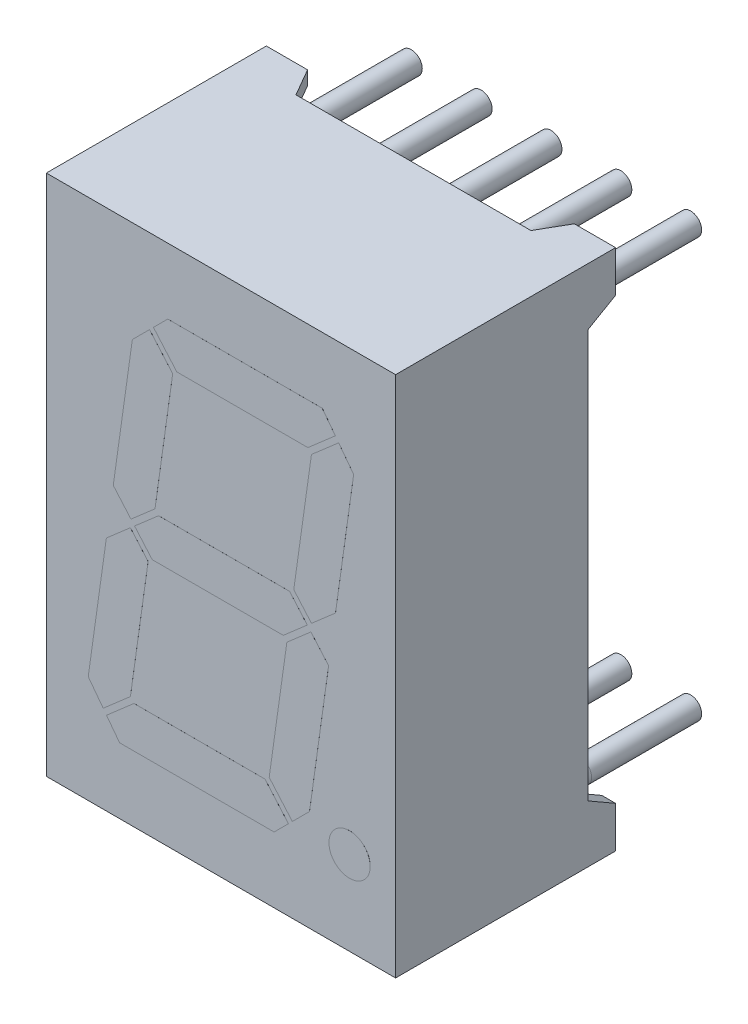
ISO-10303-21;
HEADER;
FILE_DESCRIPTION(('STEP AP214'),'2;1');
FILE_NAME('part.step','',(''),(''),'','','');
FILE_SCHEMA(('AUTOMOTIVE_DESIGN { 1 0 10303 214 1 1 1 1 }'));
ENDSEC;
DATA;
#1=APPLICATION_CONTEXT('core data for automotive mechanical design processes');
#2=APPLICATION_PROTOCOL_DEFINITION('international standard','automotive_design',2000,#1);
#3=PRODUCT_CONTEXT('',#1,'mechanical');
#4=PRODUCT('Part','Part','',(#3));
#5=PRODUCT_RELATED_PRODUCT_CATEGORY('part','',(#4));
#6=PRODUCT_DEFINITION_FORMATION('','',#4);
#7=PRODUCT_DEFINITION_CONTEXT('part definition',#1,'design');
#8=PRODUCT_DEFINITION('design','',#6,#7);
#9=PRODUCT_DEFINITION_SHAPE('','',#8);
#10=(LENGTH_UNIT() NAMED_UNIT(*) SI_UNIT(.MILLI.,.METRE.));
#11=(NAMED_UNIT(*) PLANE_ANGLE_UNIT() SI_UNIT($,.RADIAN.));
#12=(NAMED_UNIT(*) SI_UNIT($,.STERADIAN.) SOLID_ANGLE_UNIT());
#13=UNCERTAINTY_MEASURE_WITH_UNIT(LENGTH_MEASURE(1.E-05),#10,'distance_accuracy_value','');
#14=(GEOMETRIC_REPRESENTATION_CONTEXT(3) GLOBAL_UNCERTAINTY_ASSIGNED_CONTEXT((#13)) GLOBAL_UNIT_ASSIGNED_CONTEXT((#10,
#11,#12)) REPRESENTATION_CONTEXT('',''));
#15=CARTESIAN_POINT('',(0.,0.,0.));
#16=DIRECTION('',(0.,0.,1.));
#17=DIRECTION('',(1.,0.,0.));
#18=AXIS2_PLACEMENT_3D('',#15,#16,#17);
#19=CARTESIAN_POINT('',(0.,-7.62,-4.));
#20=DIRECTION('',(0.,0.,1.));
#21=DIRECTION('',(1.,0.,0.));
#22=AXIS2_PLACEMENT_3D('',#19,#20,#21);
#23=CYLINDRICAL_SURFACE('',#22,0.4);
#24=CARTESIAN_POINT('',(0.,-7.62,-4.));
#25=DIRECTION('',(0.,0.,1.));
#26=DIRECTION('',(-1.,0.,0.));
#27=AXIS2_PLACEMENT_3D('',#24,#25,#26);
#28=CIRCLE('',#27,0.4);
#29=CARTESIAN_POINT('',(-0.400000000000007,-7.62,-4.));
#30=VERTEX_POINT('',#29);
#31=EDGE_CURVE('E11',#30,#30,#28,.T.);
#32=ORIENTED_EDGE('',*,*,#31,.T.);
#33=EDGE_LOOP('',(#32));
#34=FACE_BOUND('',#33,.T.);
#35=CARTESIAN_POINT('',(0.,-7.62,0.));
#36=DIRECTION('',(0.,0.,1.));
#37=DIRECTION('',(-1.,0.,0.));
#38=AXIS2_PLACEMENT_3D('',#35,#36,#37);
#39=CIRCLE('',#38,0.4);
#40=CARTESIAN_POINT('',(-0.400000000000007,-7.62,0.));
#41=VERTEX_POINT('',#40);
#42=EDGE_CURVE('E45',#41,#41,#39,.T.);
#43=ORIENTED_EDGE('',*,*,#42,.F.);
#44=EDGE_LOOP('',(#43));
#45=FACE_BOUND('',#44,.T.);
#46=ADVANCED_FACE('F42',(#34,#45),#23,.T.);
#47=CARTESIAN_POINT('',(0.,-7.62,-4.));
#48=DIRECTION('',(0.,0.,-1.));
#49=DIRECTION('',(-1.,0.,0.));
#50=AXIS2_PLACEMENT_3D('',#47,#48,#49);
#51=PLANE('',#50);
#52=ORIENTED_EDGE('',*,*,#31,.F.);
#53=EDGE_LOOP('',(#52));
#54=FACE_BOUND('',#53,.T.);
#55=ADVANCED_FACE('F57',(#54),#51,.T.);
#56=CARTESIAN_POINT('',(0.,-7.62,0.));
#57=DIRECTION('',(0.,0.,-1.));
#58=DIRECTION('',(-1.,0.,0.));
#59=AXIS2_PLACEMENT_3D('',#56,#57,#58);
#60=PLANE('',#59);
#61=ORIENTED_EDGE('',*,*,#42,.T.);
#62=EDGE_LOOP('',(#61));
#63=FACE_BOUND('',#62,.T.);
#64=ADVANCED_FACE('F54',(#63),#60,.F.);
#65=CLOSED_SHELL('',(#46,#55,#64));
#66=MANIFOLD_SOLID_BREP('B2',#65);
#67=CARTESIAN_POINT('',(2.53999999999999,-7.62,-4.));
#68=DIRECTION('',(0.,0.,1.));
#69=DIRECTION('',(1.,0.,0.));
#70=AXIS2_PLACEMENT_3D('',#67,#68,#69);
#71=CYLINDRICAL_SURFACE('',#70,0.4);
#72=CARTESIAN_POINT('',(2.53999999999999,-7.62,-4.));
#73=DIRECTION('',(0.,0.,1.));
#74=DIRECTION('',(-1.,0.,0.));
#75=AXIS2_PLACEMENT_3D('',#72,#73,#74);
#76=CIRCLE('',#75,0.4);
#77=CARTESIAN_POINT('',(2.13999999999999,-7.62,-4.));
#78=VERTEX_POINT('',#77);
#79=EDGE_CURVE('E41',#78,#78,#76,.T.);
#80=ORIENTED_EDGE('',*,*,#79,.T.);
#81=EDGE_LOOP('',(#80));
#82=FACE_BOUND('',#81,.T.);
#83=CARTESIAN_POINT('',(2.53999999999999,-7.62,0.));
#84=DIRECTION('',(0.,0.,1.));
#85=DIRECTION('',(-1.,0.,0.));
#86=AXIS2_PLACEMENT_3D('',#83,#84,#85);
#87=CIRCLE('',#86,0.4);
#88=CARTESIAN_POINT('',(2.13999999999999,-7.62,0.));
#89=VERTEX_POINT('',#88);
#90=EDGE_CURVE('E94',#89,#89,#87,.T.);
#91=ORIENTED_EDGE('',*,*,#90,.F.);
#92=EDGE_LOOP('',(#91));
#93=FACE_BOUND('',#92,.T.);
#94=ADVANCED_FACE('F91',(#82,#93),#71,.T.);
#95=CARTESIAN_POINT('',(2.53999999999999,-7.62,-4.));
#96=DIRECTION('',(0.,0.,-1.));
#97=DIRECTION('',(-1.,0.,0.));
#98=AXIS2_PLACEMENT_3D('',#95,#96,#97);
#99=PLANE('',#98);
#100=ORIENTED_EDGE('',*,*,#79,.F.);
#101=EDGE_LOOP('',(#100));
#102=FACE_BOUND('',#101,.T.);
#103=ADVANCED_FACE('F106',(#102),#99,.T.);
#104=CARTESIAN_POINT('',(2.53999999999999,-7.62,0.));
#105=DIRECTION('',(0.,0.,-1.));
#106=DIRECTION('',(-1.,0.,0.));
#107=AXIS2_PLACEMENT_3D('',#104,#105,#106);
#108=PLANE('',#107);
#109=ORIENTED_EDGE('',*,*,#90,.T.);
#110=EDGE_LOOP('',(#109));
#111=FACE_BOUND('',#110,.T.);
#112=ADVANCED_FACE('F103',(#111),#108,.F.);
#113=CLOSED_SHELL('',(#94,#103,#112));
#114=MANIFOLD_SOLID_BREP('B6',#113);
#115=CARTESIAN_POINT('',(5.07999999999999,-7.62,-4.));
#116=DIRECTION('',(0.,0.,1.));
#117=DIRECTION('',(1.,0.,0.));
#118=AXIS2_PLACEMENT_3D('',#115,#116,#117);
#119=CYLINDRICAL_SURFACE('',#118,0.4);
#120=CARTESIAN_POINT('',(5.07999999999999,-7.62,-4.));
#121=DIRECTION('',(0.,0.,1.));
#122=DIRECTION('',(-1.,0.,0.));
#123=AXIS2_PLACEMENT_3D('',#120,#121,#122);
#124=CIRCLE('',#123,0.4);
#125=CARTESIAN_POINT('',(4.67999999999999,-7.62,-4.));
#126=VERTEX_POINT('',#125);
#127=EDGE_CURVE('E90',#126,#126,#124,.T.);
#128=ORIENTED_EDGE('',*,*,#127,.T.);
#129=EDGE_LOOP('',(#128));
#130=FACE_BOUND('',#129,.T.);
#131=CARTESIAN_POINT('',(5.07999999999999,-7.62,0.));
#132=DIRECTION('',(0.,0.,1.));
#133=DIRECTION('',(-1.,0.,0.));
#134=AXIS2_PLACEMENT_3D('',#131,#132,#133);
#135=CIRCLE('',#134,0.4);
#136=CARTESIAN_POINT('',(4.67999999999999,-7.62,0.));
#137=VERTEX_POINT('',#136);
#138=EDGE_CURVE('E143',#137,#137,#135,.T.);
#139=ORIENTED_EDGE('',*,*,#138,.F.);
#140=EDGE_LOOP('',(#139));
#141=FACE_BOUND('',#140,.T.);
#142=ADVANCED_FACE('F140',(#130,#141),#119,.T.);
#143=CARTESIAN_POINT('',(5.07999999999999,-7.62,-4.));
#144=DIRECTION('',(0.,0.,-1.));
#145=DIRECTION('',(-1.,0.,0.));
#146=AXIS2_PLACEMENT_3D('',#143,#144,#145);
#147=PLANE('',#146);
#148=ORIENTED_EDGE('',*,*,#127,.F.);
#149=EDGE_LOOP('',(#148));
#150=FACE_BOUND('',#149,.T.);
#151=ADVANCED_FACE('F155',(#150),#147,.T.);
#152=CARTESIAN_POINT('',(5.07999999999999,-7.62,0.));
#153=DIRECTION('',(0.,0.,-1.));
#154=DIRECTION('',(-1.,0.,0.));
#155=AXIS2_PLACEMENT_3D('',#152,#153,#154);
#156=PLANE('',#155);
#157=ORIENTED_EDGE('',*,*,#138,.T.);
#158=EDGE_LOOP('',(#157));
#159=FACE_BOUND('',#158,.T.);
#160=ADVANCED_FACE('F152',(#159),#156,.F.);
#161=CLOSED_SHELL('',(#142,#151,#160));
#162=MANIFOLD_SOLID_BREP('B36',#161);
#163=CARTESIAN_POINT('',(-2.54000000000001,-7.61999999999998,-4.));
#164=DIRECTION('',(0.,0.,1.));
#165=DIRECTION('',(1.,0.,0.));
#166=AXIS2_PLACEMENT_3D('',#163,#164,#165);
#167=CYLINDRICAL_SURFACE('',#166,0.4);
#168=CARTESIAN_POINT('',(-2.54000000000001,-7.61999999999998,-4.));
#169=DIRECTION('',(0.,0.,1.));
#170=DIRECTION('',(-1.,0.,0.));
#171=AXIS2_PLACEMENT_3D('',#168,#169,#170);
#172=CIRCLE('',#171,0.4);
#173=CARTESIAN_POINT('',(-2.94000000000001,-7.61999999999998,-4.));
#174=VERTEX_POINT('',#173);
#175=EDGE_CURVE('E139',#174,#174,#172,.T.);
#176=ORIENTED_EDGE('',*,*,#175,.T.);
#177=EDGE_LOOP('',(#176));
#178=FACE_BOUND('',#177,.T.);
#179=CARTESIAN_POINT('',(-2.54000000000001,-7.61999999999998,0.));
#180=DIRECTION('',(0.,0.,1.));
#181=DIRECTION('',(-1.,0.,0.));
#182=AXIS2_PLACEMENT_3D('',#179,#180,#181);
#183=CIRCLE('',#182,0.4);
#184=CARTESIAN_POINT('',(-2.94000000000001,-7.61999999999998,0.));
#185=VERTEX_POINT('',#184);
#186=EDGE_CURVE('E192',#185,#185,#183,.T.);
#187=ORIENTED_EDGE('',*,*,#186,.F.);
#188=EDGE_LOOP('',(#187));
#189=FACE_BOUND('',#188,.T.);
#190=ADVANCED_FACE('F189',(#178,#189),#167,.T.);
#191=CARTESIAN_POINT('',(-2.54000000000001,-7.61999999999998,-4.));
#192=DIRECTION('',(0.,0.,-1.));
#193=DIRECTION('',(-1.,0.,0.));
#194=AXIS2_PLACEMENT_3D('',#191,#192,#193);
#195=PLANE('',#194);
#196=ORIENTED_EDGE('',*,*,#175,.F.);
#197=EDGE_LOOP('',(#196));
#198=FACE_BOUND('',#197,.T.);
#199=ADVANCED_FACE('F204',(#198),#195,.T.);
#200=CARTESIAN_POINT('',(-2.54000000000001,-7.61999999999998,0.));
#201=DIRECTION('',(0.,0.,-1.));
#202=DIRECTION('',(-1.,0.,0.));
#203=AXIS2_PLACEMENT_3D('',#200,#201,#202);
#204=PLANE('',#203);
#205=ORIENTED_EDGE('',*,*,#186,.T.);
#206=EDGE_LOOP('',(#205));
#207=FACE_BOUND('',#206,.T.);
#208=ADVANCED_FACE('F201',(#207),#204,.F.);
#209=CLOSED_SHELL('',(#190,#199,#208));
#210=MANIFOLD_SOLID_BREP('B85',#209);
#211=CARTESIAN_POINT('',(-5.08,-7.61999999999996,-4.));
#212=DIRECTION('',(0.,0.,1.));
#213=DIRECTION('',(1.,0.,0.));
#214=AXIS2_PLACEMENT_3D('',#211,#212,#213);
#215=CYLINDRICAL_SURFACE('',#214,0.4);
#216=CARTESIAN_POINT('',(-5.08,-7.61999999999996,-4.));
#217=DIRECTION('',(0.,0.,1.));
#218=DIRECTION('',(-1.,0.,0.));
#219=AXIS2_PLACEMENT_3D('',#216,#217,#218);
#220=CIRCLE('',#219,0.4);
#221=CARTESIAN_POINT('',(-5.48,-7.61999999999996,-4.));
#222=VERTEX_POINT('',#221);
#223=EDGE_CURVE('E188',#222,#222,#220,.T.);
#224=ORIENTED_EDGE('',*,*,#223,.T.);
#225=EDGE_LOOP('',(#224));
#226=FACE_BOUND('',#225,.T.);
#227=CARTESIAN_POINT('',(-5.08,-7.61999999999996,0.));
#228=DIRECTION('',(0.,0.,1.));
#229=DIRECTION('',(-1.,0.,0.));
#230=AXIS2_PLACEMENT_3D('',#227,#228,#229);
#231=CIRCLE('',#230,0.4);
#232=CARTESIAN_POINT('',(-5.48,-7.61999999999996,0.));
#233=VERTEX_POINT('',#232);
#234=EDGE_CURVE('E241',#233,#233,#231,.T.);
#235=ORIENTED_EDGE('',*,*,#234,.F.);
#236=EDGE_LOOP('',(#235));
#237=FACE_BOUND('',#236,.T.);
#238=ADVANCED_FACE('F238',(#226,#237),#215,.T.);
#239=CARTESIAN_POINT('',(-5.08,-7.61999999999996,-4.));
#240=DIRECTION('',(0.,0.,-1.));
#241=DIRECTION('',(-1.,0.,0.));
#242=AXIS2_PLACEMENT_3D('',#239,#240,#241);
#243=PLANE('',#242);
#244=ORIENTED_EDGE('',*,*,#223,.F.);
#245=EDGE_LOOP('',(#244));
#246=FACE_BOUND('',#245,.T.);
#247=ADVANCED_FACE('F253',(#246),#243,.T.);
#248=CARTESIAN_POINT('',(-5.08,-7.61999999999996,0.));
#249=DIRECTION('',(0.,0.,-1.));
#250=DIRECTION('',(-1.,0.,0.));
#251=AXIS2_PLACEMENT_3D('',#248,#249,#250);
#252=PLANE('',#251);
#253=ORIENTED_EDGE('',*,*,#234,.T.);
#254=EDGE_LOOP('',(#253));
#255=FACE_BOUND('',#254,.T.);
#256=ADVANCED_FACE('F250',(#255),#252,.F.);
#257=CLOSED_SHELL('',(#238,#247,#256));
#258=MANIFOLD_SOLID_BREP('B134',#257);
#259=CARTESIAN_POINT('',(-5.08,7.61999999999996,-4.));
#260=DIRECTION('',(0.,0.,1.));
#261=DIRECTION('',(1.,0.,0.));
#262=AXIS2_PLACEMENT_3D('',#259,#260,#261);
#263=CYLINDRICAL_SURFACE('',#262,0.4);
#264=CARTESIAN_POINT('',(-5.08,7.61999999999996,-4.));
#265=DIRECTION('',(0.,0.,1.));
#266=DIRECTION('',(1.,0.,0.));
#267=AXIS2_PLACEMENT_3D('',#264,#265,#266);
#268=CIRCLE('',#267,0.4);
#269=CARTESIAN_POINT('',(-4.68,7.61999999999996,-4.));
#270=VERTEX_POINT('',#269);
#271=EDGE_CURVE('E237',#270,#270,#268,.T.);
#272=ORIENTED_EDGE('',*,*,#271,.T.);
#273=EDGE_LOOP('',(#272));
#274=FACE_BOUND('',#273,.T.);
#275=CARTESIAN_POINT('',(-5.08,7.61999999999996,0.));
#276=DIRECTION('',(0.,0.,1.));
#277=DIRECTION('',(1.,0.,0.));
#278=AXIS2_PLACEMENT_3D('',#275,#276,#277);
#279=CIRCLE('',#278,0.4);
#280=CARTESIAN_POINT('',(-4.68,7.61999999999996,0.));
#281=VERTEX_POINT('',#280);
#282=EDGE_CURVE('E290',#281,#281,#279,.T.);
#283=ORIENTED_EDGE('',*,*,#282,.F.);
#284=EDGE_LOOP('',(#283));
#285=FACE_BOUND('',#284,.T.);
#286=ADVANCED_FACE('F287',(#274,#285),#263,.T.);
#287=CARTESIAN_POINT('',(-5.08,7.61999999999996,-4.));
#288=DIRECTION('',(0.,0.,1.));
#289=DIRECTION('',(1.,0.,0.));
#290=AXIS2_PLACEMENT_3D('',#287,#288,#289);
#291=PLANE('',#290);
#292=ORIENTED_EDGE('',*,*,#271,.F.);
#293=EDGE_LOOP('',(#292));
#294=FACE_BOUND('',#293,.T.);
#295=ADVANCED_FACE('F302',(#294),#291,.F.);
#296=CARTESIAN_POINT('',(-5.08,7.61999999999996,0.));
#297=DIRECTION('',(0.,0.,1.));
#298=DIRECTION('',(1.,0.,0.));
#299=AXIS2_PLACEMENT_3D('',#296,#297,#298);
#300=PLANE('',#299);
#301=ORIENTED_EDGE('',*,*,#282,.T.);
#302=EDGE_LOOP('',(#301));
#303=FACE_BOUND('',#302,.T.);
#304=ADVANCED_FACE('F299',(#303),#300,.T.);
#305=CLOSED_SHELL('',(#286,#295,#304));
#306=MANIFOLD_SOLID_BREP('B183',#305);
#307=CARTESIAN_POINT('',(5.08,7.62,-4.));
#308=DIRECTION('',(0.,0.,1.));
#309=DIRECTION('',(1.,0.,0.));
#310=AXIS2_PLACEMENT_3D('',#307,#308,#309);
#311=CYLINDRICAL_SURFACE('',#310,0.4);
#312=CARTESIAN_POINT('',(5.08,7.62,-4.));
#313=DIRECTION('',(0.,0.,1.));
#314=DIRECTION('',(1.,0.,0.));
#315=AXIS2_PLACEMENT_3D('',#312,#313,#314);
#316=CIRCLE('',#315,0.4);
#317=CARTESIAN_POINT('',(5.48,7.62,-4.));
#318=VERTEX_POINT('',#317);
#319=EDGE_CURVE('E286',#318,#318,#316,.T.);
#320=ORIENTED_EDGE('',*,*,#319,.T.);
#321=EDGE_LOOP('',(#320));
#322=FACE_BOUND('',#321,.T.);
#323=CARTESIAN_POINT('',(5.08,7.62,0.));
#324=DIRECTION('',(0.,0.,1.));
#325=DIRECTION('',(1.,0.,0.));
#326=AXIS2_PLACEMENT_3D('',#323,#324,#325);
#327=CIRCLE('',#326,0.4);
#328=CARTESIAN_POINT('',(5.48,7.62,0.));
#329=VERTEX_POINT('',#328);
#330=EDGE_CURVE('E340',#329,#329,#327,.T.);
#331=ORIENTED_EDGE('',*,*,#330,.F.);
#332=EDGE_LOOP('',(#331));
#333=FACE_BOUND('',#332,.T.);
#334=ADVANCED_FACE('F337',(#322,#333),#311,.T.);
#335=CARTESIAN_POINT('',(5.08,7.62,-4.));
#336=DIRECTION('',(0.,0.,1.));
#337=DIRECTION('',(1.,0.,0.));
#338=AXIS2_PLACEMENT_3D('',#335,#336,#337);
#339=PLANE('',#338);
#340=ORIENTED_EDGE('',*,*,#319,.F.);
#341=EDGE_LOOP('',(#340));
#342=FACE_BOUND('',#341,.T.);
#343=ADVANCED_FACE('F352',(#342),#339,.F.);
#344=CARTESIAN_POINT('',(5.08,7.62,0.));
#345=DIRECTION('',(0.,0.,1.));
#346=DIRECTION('',(1.,0.,0.));
#347=AXIS2_PLACEMENT_3D('',#344,#345,#346);
#348=PLANE('',#347);
#349=ORIENTED_EDGE('',*,*,#330,.T.);
#350=EDGE_LOOP('',(#349));
#351=FACE_BOUND('',#350,.T.);
#352=ADVANCED_FACE('F349',(#351),#348,.T.);
#353=CLOSED_SHELL('',(#334,#343,#352));
#354=MANIFOLD_SOLID_BREP('B232',#353);
#355=CARTESIAN_POINT('',(0.,0.,1.));
#356=DIRECTION('',(0.,0.,1.));
#357=DIRECTION('',(1.,0.,0.));
#358=AXIS2_PLACEMENT_3D('',#355,#356,#357);
#359=PLANE('',#358);
#360=CARTESIAN_POINT('',(2.53999999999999,-7.62,1.));
#361=DIRECTION('',(0.,0.,1.));
#362=DIRECTION('',(1.,0.,0.));
#363=AXIS2_PLACEMENT_3D('',#360,#361,#362);
#364=CIRCLE('',#363,0.4);
#365=CARTESIAN_POINT('',(2.93999999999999,-7.62,1.));
#366=VERTEX_POINT('',#365);
#367=EDGE_CURVE('E386',#366,#366,#364,.F.);
#368=ORIENTED_EDGE('',*,*,#367,.F.);
#369=EDGE_LOOP('',(#368));
#370=FACE_BOUND('',#369,.T.);
#371=CARTESIAN_POINT('',(-2.54000000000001,-7.61999999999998,1.));
#372=DIRECTION('',(0.,0.,1.));
#373=DIRECTION('',(1.,0.,0.));
#374=AXIS2_PLACEMENT_3D('',#371,#372,#373);
#375=CIRCLE('',#374,0.4);
#376=CARTESIAN_POINT('',(-2.14000000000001,-7.61999999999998,1.));
#377=VERTEX_POINT('',#376);
#378=EDGE_CURVE('E1285',#377,#377,#375,.F.);
#379=ORIENTED_EDGE('',*,*,#378,.F.);
#380=EDGE_LOOP('',(#379));
#381=FACE_BOUND('',#380,.T.);
#382=CARTESIAN_POINT('',(-5.08,7.61999999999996,1.));
#383=DIRECTION('',(0.,0.,1.));
#384=DIRECTION('',(1.,0.,0.));
#385=AXIS2_PLACEMENT_3D('',#382,#383,#384);
#386=CIRCLE('',#385,0.4);
#387=CARTESIAN_POINT('',(-4.68,7.61999999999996,1.));
#388=VERTEX_POINT('',#387);
#389=EDGE_CURVE('E1279',#388,#388,#386,.F.);
#390=ORIENTED_EDGE('',*,*,#389,.F.);
#391=EDGE_LOOP('',(#390));
#392=FACE_BOUND('',#391,.T.);
#393=CARTESIAN_POINT('',(5.08,7.62,1.));
#394=DIRECTION('',(0.,0.,1.));
#395=DIRECTION('',(1.,0.,0.));
#396=AXIS2_PLACEMENT_3D('',#393,#394,#395);
#397=CIRCLE('',#396,0.4);
#398=CARTESIAN_POINT('',(5.48,7.62,1.));
#399=VERTEX_POINT('',#398);
#400=EDGE_CURVE('E1273',#399,#399,#397,.F.);
#401=ORIENTED_EDGE('',*,*,#400,.F.);
#402=EDGE_LOOP('',(#401));
#403=FACE_BOUND('',#402,.T.);
#404=CARTESIAN_POINT('',(0.,7.62,1.));
#405=DIRECTION('',(0.,0.,1.));
#406=DIRECTION('',(1.,0.,0.));
#407=AXIS2_PLACEMENT_3D('',#404,#405,#406);
#408=CIRCLE('',#407,0.4);
#409=CARTESIAN_POINT('',(0.4,7.62,1.));
#410=VERTEX_POINT('',#409);
#411=EDGE_CURVE('E1267',#410,#410,#408,.F.);
#412=ORIENTED_EDGE('',*,*,#411,.F.);
#413=EDGE_LOOP('',(#412));
#414=FACE_BOUND('',#413,.T.);
#415=DIRECTION('',(1.,0.,0.));
#416=VECTOR('',#415,1.);
#417=CARTESIAN_POINT('',(-5.85,-9.,1.));
#418=LINE('',#417,#416);
#419=CARTESIAN_POINT('',(4.27264973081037,-9.,1.));
#420=VERTEX_POINT('',#419);
#421=CARTESIAN_POINT('',(5.85,-9.,1.));
#422=VERTEX_POINT('',#421);
#423=EDGE_CURVE('E896',#420,#422,#418,.T.);
#424=ORIENTED_EDGE('',*,*,#423,.F.);
#425=DIRECTION('',(0.,1.,0.));
#426=VECTOR('',#425,1.);
#427=CARTESIAN_POINT('',(4.27264973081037,-9.5,1.));
#428=LINE('',#427,#426);
#429=CARTESIAN_POINT('',(4.27264973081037,-9.5,1.));
#430=VERTEX_POINT('',#429);
#431=EDGE_CURVE('E803',#430,#420,#428,.T.);
#432=ORIENTED_EDGE('',*,*,#431,.F.);
#433=DIRECTION('',(1.,0.,0.));
#434=VECTOR('',#433,1.);
#435=CARTESIAN_POINT('',(-4.27264973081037,-9.5,1.));
#436=LINE('',#435,#434);
#437=CARTESIAN_POINT('',(-4.27264973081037,-9.5,1.));
#438=VERTEX_POINT('',#437);
#439=EDGE_CURVE('E800',#438,#430,#436,.T.);
#440=ORIENTED_EDGE('',*,*,#439,.F.);
#441=DIRECTION('',(0.,1.,0.));
#442=VECTOR('',#441,1.);
#443=CARTESIAN_POINT('',(-4.27264973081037,-9.5,1.));
#444=LINE('',#443,#442);
#445=CARTESIAN_POINT('',(-4.27264973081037,-9.,1.));
#446=VERTEX_POINT('',#445);
#447=EDGE_CURVE('E400',#438,#446,#444,.T.);
#448=ORIENTED_EDGE('',*,*,#447,.T.);
#449=CARTESIAN_POINT('',(-5.85,-9.,1.));
#450=VERTEX_POINT('',#449);
#451=EDGE_CURVE('E897',#450,#446,#418,.T.);
#452=ORIENTED_EDGE('',*,*,#451,.F.);
#453=DIRECTION('',(0.,-1.,0.));
#454=VECTOR('',#453,1.);
#455=CARTESIAN_POINT('',(-5.85,9.,1.));
#456=LINE('',#455,#454);
#457=CARTESIAN_POINT('',(-5.85,-7.42264973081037,1.));
#458=VERTEX_POINT('',#457);
#459=EDGE_CURVE('E892',#458,#450,#456,.T.);
#460=ORIENTED_EDGE('',*,*,#459,.F.);
#461=DIRECTION('',(1.,0.,0.));
#462=VECTOR('',#461,1.);
#463=CARTESIAN_POINT('',(-6.35,-7.42264973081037,1.));
#464=LINE('',#463,#462);
#465=CARTESIAN_POINT('',(-6.35,-7.42264973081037,1.));
#466=VERTEX_POINT('',#465);
#467=EDGE_CURVE('E871',#466,#458,#464,.T.);
#468=ORIENTED_EDGE('',*,*,#467,.F.);
#469=DIRECTION('',(0.,-1.,0.));
#470=VECTOR('',#469,1.);
#471=CARTESIAN_POINT('',(-6.35,7.42264973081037,1.));
#472=LINE('',#471,#470);
#473=CARTESIAN_POINT('',(-6.35,7.42264973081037,1.));
#474=VERTEX_POINT('',#473);
#475=EDGE_CURVE('E845',#474,#466,#472,.T.);
#476=ORIENTED_EDGE('',*,*,#475,.F.);
#477=DIRECTION('',(1.,0.,0.));
#478=VECTOR('',#477,1.);
#479=CARTESIAN_POINT('',(-6.35,7.42264973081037,1.));
#480=LINE('',#479,#478);
#481=CARTESIAN_POINT('',(-5.85,7.42264973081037,1.));
#482=VERTEX_POINT('',#481);
#483=EDGE_CURVE('E867',#474,#482,#480,.T.);
#484=ORIENTED_EDGE('',*,*,#483,.T.);
#485=CARTESIAN_POINT('',(-5.85,9.,1.));
#486=VERTEX_POINT('',#485);
#487=EDGE_CURVE('E893',#486,#482,#456,.T.);
#488=ORIENTED_EDGE('',*,*,#487,.F.);
#489=DIRECTION('',(-1.,0.,0.));
#490=VECTOR('',#489,1.);
#491=CARTESIAN_POINT('',(-5.85,9.,1.));
#492=LINE('',#491,#490);
#493=CARTESIAN_POINT('',(-4.27264973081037,9.,1.));
#494=VERTEX_POINT('',#493);
#495=EDGE_CURVE('E887',#494,#486,#492,.T.);
#496=ORIENTED_EDGE('',*,*,#495,.F.);
#497=CARTESIAN_POINT('',(-4.27264973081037,9.5,1.));
#498=VERTEX_POINT('',#497);
#499=EDGE_CURVE('E797',#494,#498,#444,.T.);
#500=ORIENTED_EDGE('',*,*,#499,.T.);
#501=DIRECTION('',(1.,0.,0.));
#502=VECTOR('',#501,1.);
#503=CARTESIAN_POINT('',(-4.27264973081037,9.5,1.));
#504=LINE('',#503,#502);
#505=CARTESIAN_POINT('',(4.27264973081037,9.5,1.));
#506=VERTEX_POINT('',#505);
#507=EDGE_CURVE('E816',#498,#506,#504,.T.);
#508=ORIENTED_EDGE('',*,*,#507,.T.);
#509=CARTESIAN_POINT('',(4.27264973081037,9.,1.));
#510=VERTEX_POINT('',#509);
#511=EDGE_CURVE('E393',#510,#506,#428,.T.);
#512=ORIENTED_EDGE('',*,*,#511,.F.);
#513=CARTESIAN_POINT('',(5.85,9.,1.));
#514=VERTEX_POINT('',#513);
#515=EDGE_CURVE('E889',#514,#510,#492,.T.);
#516=ORIENTED_EDGE('',*,*,#515,.F.);
#517=DIRECTION('',(0.,1.,0.));
#518=VECTOR('',#517,1.);
#519=CARTESIAN_POINT('',(5.85,9.,1.));
#520=LINE('',#519,#518);
#521=CARTESIAN_POINT('',(5.85,7.42264973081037,1.));
#522=VERTEX_POINT('',#521);
#523=EDGE_CURVE('E888',#522,#514,#520,.T.);
#524=ORIENTED_EDGE('',*,*,#523,.F.);
#525=CARTESIAN_POINT('',(6.35,7.42264973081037,1.));
#526=VERTEX_POINT('',#525);
#527=EDGE_CURVE('E866',#522,#526,#480,.T.);
#528=ORIENTED_EDGE('',*,*,#527,.T.);
#529=DIRECTION('',(0.,-1.,0.));
#530=VECTOR('',#529,1.);
#531=CARTESIAN_POINT('',(6.35,7.42264973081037,1.));
#532=LINE('',#531,#530);
#533=CARTESIAN_POINT('',(6.35,-7.42264973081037,1.));
#534=VERTEX_POINT('',#533);
#535=EDGE_CURVE('E855',#526,#534,#532,.T.);
#536=ORIENTED_EDGE('',*,*,#535,.T.);
#537=CARTESIAN_POINT('',(5.85,-7.42264973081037,1.));
#538=VERTEX_POINT('',#537);
#539=EDGE_CURVE('E870',#538,#534,#464,.T.);
#540=ORIENTED_EDGE('',*,*,#539,.F.);
#541=EDGE_CURVE('E884',#422,#538,#520,.T.);
#542=ORIENTED_EDGE('',*,*,#541,.F.);
#543=EDGE_LOOP('',(#424,#432,#440,#448,#452,#460,#468,#476,#484,#488,#496,#500,#508,#512,#516,
#524,#528,#536,#540,#542));
#544=FACE_BOUND('',#543,.T.);
#545=CARTESIAN_POINT('',(2.54,7.62,1.));
#546=DIRECTION('',(0.,0.,1.));
#547=DIRECTION('',(1.,0.,0.));
#548=AXIS2_PLACEMENT_3D('',#545,#546,#547);
#549=CIRCLE('',#548,0.4);
#550=CARTESIAN_POINT('',(2.94,7.62,1.));
#551=VERTEX_POINT('',#550);
#552=EDGE_CURVE('E1270',#551,#551,#549,.F.);
#553=ORIENTED_EDGE('',*,*,#552,.F.);
#554=EDGE_LOOP('',(#553));
#555=FACE_BOUND('',#554,.T.);
#556=CARTESIAN_POINT('',(-2.54,7.61999999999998,1.));
#557=DIRECTION('',(0.,0.,1.));
#558=DIRECTION('',(1.,0.,0.));
#559=AXIS2_PLACEMENT_3D('',#556,#557,#558);
#560=CIRCLE('',#559,0.4);
#561=CARTESIAN_POINT('',(-2.14,7.61999999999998,1.));
#562=VERTEX_POINT('',#561);
#563=EDGE_CURVE('E1276',#562,#562,#560,.F.);
#564=ORIENTED_EDGE('',*,*,#563,.F.);
#565=EDGE_LOOP('',(#564));
#566=FACE_BOUND('',#565,.T.);
#567=CARTESIAN_POINT('',(-5.08,-7.61999999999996,1.));
#568=DIRECTION('',(0.,0.,1.));
#569=DIRECTION('',(1.,0.,0.));
#570=AXIS2_PLACEMENT_3D('',#567,#568,#569);
#571=CIRCLE('',#570,0.4);
#572=CARTESIAN_POINT('',(-4.68,-7.61999999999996,1.));
#573=VERTEX_POINT('',#572);
#574=EDGE_CURVE('E1282',#573,#573,#571,.F.);
#575=ORIENTED_EDGE('',*,*,#574,.F.);
#576=EDGE_LOOP('',(#575));
#577=FACE_BOUND('',#576,.T.);
#578=CARTESIAN_POINT('',(5.07999999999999,-7.62,1.));
#579=DIRECTION('',(0.,0.,1.));
#580=DIRECTION('',(1.,0.,0.));
#581=AXIS2_PLACEMENT_3D('',#578,#579,#580);
#582=CIRCLE('',#581,0.4);
#583=CARTESIAN_POINT('',(5.47999999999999,-7.62,1.));
#584=VERTEX_POINT('',#583);
#585=EDGE_CURVE('E1288',#584,#584,#582,.F.);
#586=ORIENTED_EDGE('',*,*,#585,.F.);
#587=EDGE_LOOP('',(#586));
#588=FACE_BOUND('',#587,.T.);
#589=CARTESIAN_POINT('',(0.,-7.62,1.));
#590=DIRECTION('',(0.,0.,1.));
#591=DIRECTION('',(1.,0.,0.));
#592=AXIS2_PLACEMENT_3D('',#589,#590,#591);
#593=CIRCLE('',#592,0.4);
#594=CARTESIAN_POINT('',(0.399999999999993,-7.62,1.));
#595=VERTEX_POINT('',#594);
#596=EDGE_CURVE('E335',#595,#595,#593,.F.);
#597=ORIENTED_EDGE('',*,*,#596,.F.);
#598=EDGE_LOOP('',(#597));
#599=FACE_BOUND('',#598,.T.);
#600=ADVANCED_FACE('F378',(#370,#381,#392,#403,#414,#544,#555,#566,#577,#588,#599),#359,.F.);
#601=CARTESIAN_POINT('',(0.,0.,0.));
#602=DIRECTION('',(0.,0.,1.));
#603=DIRECTION('',(1.,0.,0.));
#604=AXIS2_PLACEMENT_3D('',#601,#602,#603);
#605=PLANE('',#604);
#606=DIRECTION('',(1.,0.,0.));
#607=VECTOR('',#606,1.);
#608=CARTESIAN_POINT('',(-5.85,-9.,0.));
#609=LINE('',#608,#607);
#610=CARTESIAN_POINT('',(-5.85,-9.,0.));
#611=VERTEX_POINT('',#610);
#612=CARTESIAN_POINT('',(-4.85,-9.,0.));
#613=VERTEX_POINT('',#612);
#614=EDGE_CURVE('E912',#611,#613,#609,.T.);
#615=ORIENTED_EDGE('',*,*,#614,.T.);
#616=DIRECTION('',(0.,1.,0.));
#617=VECTOR('',#616,1.);
#618=CARTESIAN_POINT('',(-4.85,-9.5,0.));
#619=LINE('',#618,#617);
#620=CARTESIAN_POINT('',(-4.85,-9.5,0.));
#621=VERTEX_POINT('',#620);
#622=EDGE_CURVE('E827',#621,#613,#619,.T.);
#623=ORIENTED_EDGE('',*,*,#622,.F.);
#624=DIRECTION('',(1.,0.,0.));
#625=VECTOR('',#624,1.);
#626=CARTESIAN_POINT('',(-6.35,-9.5,0.));
#627=LINE('',#626,#625);
#628=CARTESIAN_POINT('',(-6.35,-9.5,0.));
#629=VERTEX_POINT('',#628);
#630=EDGE_CURVE('E813',#629,#621,#627,.T.);
#631=ORIENTED_EDGE('',*,*,#630,.F.);
#632=DIRECTION('',(0.,-1.,0.));
#633=VECTOR('',#632,1.);
#634=CARTESIAN_POINT('',(-6.35,9.5,0.));
#635=LINE('',#634,#633);
#636=CARTESIAN_POINT('',(-6.35,-8.,0.));
#637=VERTEX_POINT('',#636);
#638=EDGE_CURVE('E1251',#637,#629,#635,.T.);
#639=ORIENTED_EDGE('',*,*,#638,.F.);
#640=DIRECTION('',(1.,0.,0.));
#641=VECTOR('',#640,1.);
#642=CARTESIAN_POINT('',(-6.35,-8.,0.));
#643=LINE('',#642,#641);
#644=CARTESIAN_POINT('',(-5.85,-8.,0.));
#645=VERTEX_POINT('',#644);
#646=EDGE_CURVE('E860',#637,#645,#643,.T.);
#647=ORIENTED_EDGE('',*,*,#646,.T.);
#648=DIRECTION('',(0.,-1.,0.));
#649=VECTOR('',#648,1.);
#650=CARTESIAN_POINT('',(-5.85,9.,0.));
#651=LINE('',#650,#649);
#652=EDGE_CURVE('E907',#645,#611,#651,.T.);
#653=ORIENTED_EDGE('',*,*,#652,.T.);
#654=EDGE_LOOP('',(#615,#623,#631,#639,#647,#653));
#655=FACE_BOUND('',#654,.T.);
#656=ADVANCED_FACE('F1297',(#655),#605,.F.);
#657=DIRECTION('',(-1.,0.,0.));
#658=VECTOR('',#657,1.);
#659=CARTESIAN_POINT('',(-6.35,9.5,0.));
#660=LINE('',#659,#658);
#661=CARTESIAN_POINT('',(-4.85,9.5,0.));
#662=VERTEX_POINT('',#661);
#663=CARTESIAN_POINT('',(-6.35,9.5,0.));
#664=VERTEX_POINT('',#663);
#665=EDGE_CURVE('E1247',#662,#664,#660,.T.);
#666=ORIENTED_EDGE('',*,*,#665,.F.);
#667=CARTESIAN_POINT('',(-4.85,9.,0.));
#668=VERTEX_POINT('',#667);
#669=EDGE_CURVE('E830',#668,#662,#619,.T.);
#670=ORIENTED_EDGE('',*,*,#669,.F.);
#671=DIRECTION('',(-1.,0.,0.));
#672=VECTOR('',#671,1.);
#673=CARTESIAN_POINT('',(-5.85,9.,0.));
#674=LINE('',#673,#672);
#675=CARTESIAN_POINT('',(-5.85,9.,0.));
#676=VERTEX_POINT('',#675);
#677=EDGE_CURVE('E903',#668,#676,#674,.T.);
#678=ORIENTED_EDGE('',*,*,#677,.T.);
#679=CARTESIAN_POINT('',(-5.85,8.,0.));
#680=VERTEX_POINT('',#679);
#681=EDGE_CURVE('E908',#676,#680,#651,.T.);
#682=ORIENTED_EDGE('',*,*,#681,.T.);
#683=DIRECTION('',(1.,0.,0.));
#684=VECTOR('',#683,1.);
#685=CARTESIAN_POINT('',(-6.35,8.,0.));
#686=LINE('',#685,#684);
#687=CARTESIAN_POINT('',(-6.35,8.,0.));
#688=VERTEX_POINT('',#687);
#689=EDGE_CURVE('E864',#688,#680,#686,.T.);
#690=ORIENTED_EDGE('',*,*,#689,.F.);
#691=EDGE_CURVE('E1252',#664,#688,#635,.T.);
#692=ORIENTED_EDGE('',*,*,#691,.F.);
#693=EDGE_LOOP('',(#666,#670,#678,#682,#690,#692));
#694=FACE_BOUND('',#693,.T.);
#695=ADVANCED_FACE('F1693',(#694),#605,.F.);
#696=CARTESIAN_POINT('',(-5.85,9.,1.));
#697=DIRECTION('',(0.,-1.,0.));
#698=DIRECTION('',(0.,0.,-1.));
#699=AXIS2_PLACEMENT_3D('',#696,#697,#698);
#700=PLANE('',#699);
#701=DIRECTION('',(-0.500000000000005,0.,-0.866025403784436));
#702=VECTOR('',#701,1.);
#703=CARTESIAN_POINT('',(-4.66698729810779,9.,0.316987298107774));
#704=LINE('',#703,#702);
#705=EDGE_CURVE('E840',#494,#668,#704,.T.);
#706=ORIENTED_EDGE('',*,*,#705,.F.);
#707=ORIENTED_EDGE('',*,*,#495,.T.);
#708=DIRECTION('',(0.,0.,-1.));
#709=VECTOR('',#708,1.);
#710=CARTESIAN_POINT('',(-5.85,9.,1.));
#711=LINE('',#710,#709);
#712=EDGE_CURVE('E920',#486,#676,#711,.T.);
#713=ORIENTED_EDGE('',*,*,#712,.T.);
#714=ORIENTED_EDGE('',*,*,#677,.F.);
#715=EDGE_LOOP('',(#706,#707,#713,#714));
#716=FACE_BOUND('',#715,.T.);
#717=ADVANCED_FACE('F1454',(#716),#700,.T.);
#718=CARTESIAN_POINT('',(-5.85,-9.,1.));
#719=DIRECTION('',(0.,1.,0.));
#720=DIRECTION('',(0.,0.,1.));
#721=AXIS2_PLACEMENT_3D('',#718,#719,#720);
#722=PLANE('',#721);
#723=DIRECTION('',(0.500000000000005,0.,0.866025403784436));
#724=VECTOR('',#723,1.);
#725=CARTESIAN_POINT('',(-4.66698729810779,-9.,0.316987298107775));
#726=LINE('',#725,#724);
#727=EDGE_CURVE('E795',#613,#446,#726,.T.);
#728=ORIENTED_EDGE('',*,*,#727,.F.);
#729=ORIENTED_EDGE('',*,*,#614,.F.);
#730=DIRECTION('',(0.,0.,-1.));
#731=VECTOR('',#730,1.);
#732=CARTESIAN_POINT('',(-5.85,-9.,1.));
#733=LINE('',#732,#731);
#734=EDGE_CURVE('E917',#450,#611,#733,.T.);
#735=ORIENTED_EDGE('',*,*,#734,.F.);
#736=ORIENTED_EDGE('',*,*,#451,.T.);
#737=EDGE_LOOP('',(#728,#729,#735,#736));
#738=FACE_BOUND('',#737,.T.);
#739=ADVANCED_FACE('F1444',(#738),#722,.T.);
#740=CARTESIAN_POINT('',(4.85,-9.5,0.));
#741=VERTEX_POINT('',#740);
#742=CARTESIAN_POINT('',(6.35,-9.5,0.));
#743=VERTEX_POINT('',#742);
#744=EDGE_CURVE('E1255',#741,#743,#627,.T.);
#745=ORIENTED_EDGE('',*,*,#744,.F.);
#746=DIRECTION('',(0.,1.,0.));
#747=VECTOR('',#746,1.);
#748=CARTESIAN_POINT('',(4.85,-9.5,0.));
#749=LINE('',#748,#747);
#750=CARTESIAN_POINT('',(4.85,-9.,0.));
#751=VERTEX_POINT('',#750);
#752=EDGE_CURVE('E831',#741,#751,#749,.T.);
#753=ORIENTED_EDGE('',*,*,#752,.T.);
#754=CARTESIAN_POINT('',(5.85,-9.,0.));
#755=VERTEX_POINT('',#754);
#756=EDGE_CURVE('E911',#751,#755,#609,.T.);
#757=ORIENTED_EDGE('',*,*,#756,.T.);
#758=DIRECTION('',(0.,1.,0.));
#759=VECTOR('',#758,1.);
#760=CARTESIAN_POINT('',(5.85,9.,0.));
#761=LINE('',#760,#759);
#762=CARTESIAN_POINT('',(5.85,-8.,0.));
#763=VERTEX_POINT('',#762);
#764=EDGE_CURVE('E900',#755,#763,#761,.T.);
#765=ORIENTED_EDGE('',*,*,#764,.T.);
#766=CARTESIAN_POINT('',(6.35,-8.,0.));
#767=VERTEX_POINT('',#766);
#768=EDGE_CURVE('E852',#763,#767,#643,.T.);
#769=ORIENTED_EDGE('',*,*,#768,.T.);
#770=DIRECTION('',(0.,1.,0.));
#771=VECTOR('',#770,1.);
#772=CARTESIAN_POINT('',(6.35,9.5,0.));
#773=LINE('',#772,#771);
#774=EDGE_CURVE('E1244',#743,#767,#773,.T.);
#775=ORIENTED_EDGE('',*,*,#774,.F.);
#776=EDGE_LOOP('',(#745,#753,#757,#765,#769,#775));
#777=FACE_BOUND('',#776,.T.);
#778=ADVANCED_FACE('F1672',(#777),#605,.F.);
#779=CARTESIAN_POINT('',(6.35,9.5,8.));
#780=DIRECTION('',(-1.,0.,0.));
#781=DIRECTION('',(0.,-1.,0.));
#782=AXIS2_PLACEMENT_3D('',#779,#780,#781);
#783=PLANE('',#782);
#784=DIRECTION('',(0.,0.500000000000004,0.866025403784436));
#785=VECTOR('',#784,1.);
#786=CARTESIAN_POINT('',(6.35,-8.,0.));
#787=LINE('',#786,#785);
#788=EDGE_CURVE('E842',#767,#534,#787,.T.);
#789=ORIENTED_EDGE('',*,*,#788,.T.);
#790=ORIENTED_EDGE('',*,*,#535,.F.);
#791=DIRECTION('',(0.,-0.500000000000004,0.866025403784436));
#792=VECTOR('',#791,1.);
#793=CARTESIAN_POINT('',(6.35,8.,0.));
#794=LINE('',#793,#792);
#795=CARTESIAN_POINT('',(6.35,8.,0.));
#796=VERTEX_POINT('',#795);
#797=EDGE_CURVE('E846',#796,#526,#794,.T.);
#798=ORIENTED_EDGE('',*,*,#797,.F.);
#799=CARTESIAN_POINT('',(6.35,9.5,0.));
#800=VERTEX_POINT('',#799);
#801=EDGE_CURVE('E1233',#796,#800,#773,.T.);
#802=ORIENTED_EDGE('',*,*,#801,.T.);
#803=DIRECTION('',(0.,0.,-1.));
#804=VECTOR('',#803,1.);
#805=CARTESIAN_POINT('',(6.35,9.5,8.));
#806=LINE('',#805,#804);
#807=CARTESIAN_POINT('',(6.35,9.5,8.));
#808=VERTEX_POINT('',#807);
#809=EDGE_CURVE('E1264',#808,#800,#806,.T.);
#810=ORIENTED_EDGE('',*,*,#809,.F.);
#811=DIRECTION('',(0.,1.,0.));
#812=VECTOR('',#811,1.);
#813=CARTESIAN_POINT('',(6.35,9.5,8.));
#814=LINE('',#813,#812);
#815=CARTESIAN_POINT('',(6.35,-9.5,8.));
#816=VERTEX_POINT('',#815);
#817=EDGE_CURVE('E1234',#816,#808,#814,.T.);
#818=ORIENTED_EDGE('',*,*,#817,.F.);
#819=DIRECTION('',(0.,0.,-1.));
#820=VECTOR('',#819,1.);
#821=CARTESIAN_POINT('',(6.35,-9.5,8.));
#822=LINE('',#821,#820);
#823=EDGE_CURVE('E1243',#816,#743,#822,.T.);
#824=ORIENTED_EDGE('',*,*,#823,.T.);
#825=ORIENTED_EDGE('',*,*,#774,.T.);
#826=EDGE_LOOP('',(#789,#790,#798,#802,#810,#818,#824,#825));
#827=FACE_BOUND('',#826,.T.);
#828=ADVANCED_FACE('F380',(#827),#783,.F.);
#829=CARTESIAN_POINT('',(-6.35,9.5,8.));
#830=DIRECTION('',(1.,0.,0.));
#831=DIRECTION('',(0.,1.,0.));
#832=AXIS2_PLACEMENT_3D('',#829,#830,#831);
#833=PLANE('',#832);
#834=DIRECTION('',(0.,0.500000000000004,0.866025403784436));
#835=VECTOR('',#834,1.);
#836=CARTESIAN_POINT('',(-6.35,-8.,0.));
#837=LINE('',#836,#835);
#838=EDGE_CURVE('E843',#637,#466,#837,.T.);
#839=ORIENTED_EDGE('',*,*,#838,.F.);
#840=ORIENTED_EDGE('',*,*,#638,.T.);
#841=DIRECTION('',(0.,0.,-1.));
#842=VECTOR('',#841,1.);
#843=CARTESIAN_POINT('',(-6.35,-9.5,8.));
#844=LINE('',#843,#842);
#845=CARTESIAN_POINT('',(-6.35,-9.5,8.));
#846=VERTEX_POINT('',#845);
#847=EDGE_CURVE('E1259',#846,#629,#844,.T.);
#848=ORIENTED_EDGE('',*,*,#847,.F.);
#849=DIRECTION('',(0.,-1.,0.));
#850=VECTOR('',#849,1.);
#851=CARTESIAN_POINT('',(-6.35,9.5,8.));
#852=LINE('',#851,#850);
#853=CARTESIAN_POINT('',(-6.35,9.5,8.));
#854=VERTEX_POINT('',#853);
#855=EDGE_CURVE('E1239',#854,#846,#852,.T.);
#856=ORIENTED_EDGE('',*,*,#855,.F.);
#857=DIRECTION('',(0.,0.,-1.));
#858=VECTOR('',#857,1.);
#859=CARTESIAN_POINT('',(-6.35,9.5,8.));
#860=LINE('',#859,#858);
#861=EDGE_CURVE('E1261',#854,#664,#860,.T.);
#862=ORIENTED_EDGE('',*,*,#861,.T.);
#863=ORIENTED_EDGE('',*,*,#691,.T.);
#864=DIRECTION('',(0.,-0.500000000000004,0.866025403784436));
#865=VECTOR('',#864,1.);
#866=CARTESIAN_POINT('',(-6.35,8.,0.));
#867=LINE('',#866,#865);
#868=EDGE_CURVE('E849',#688,#474,#867,.T.);
#869=ORIENTED_EDGE('',*,*,#868,.T.);
#870=ORIENTED_EDGE('',*,*,#475,.T.);
#871=EDGE_LOOP('',(#839,#840,#848,#856,#862,#863,#869,#870));
#872=FACE_BOUND('',#871,.T.);
#873=ADVANCED_FACE('F1675',(#872),#833,.F.);
#874=CARTESIAN_POINT('',(5.85,9.,1.));
#875=DIRECTION('',(-1.,0.,0.));
#876=DIRECTION('',(0.,-1.,0.));
#877=AXIS2_PLACEMENT_3D('',#874,#875,#876);
#878=PLANE('',#877);
#879=ORIENTED_EDGE('',*,*,#541,.T.);
#880=DIRECTION('',(0.,-0.500000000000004,-0.866025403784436));
#881=VECTOR('',#880,1.);
#882=CARTESIAN_POINT('',(5.85,-3.31698729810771,8.11121593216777));
#883=LINE('',#882,#881);
#884=EDGE_CURVE('E880',#538,#763,#883,.T.);
#885=ORIENTED_EDGE('',*,*,#884,.T.);
#886=ORIENTED_EDGE('',*,*,#764,.F.);
#887=DIRECTION('',(0.,0.,-1.));
#888=VECTOR('',#887,1.);
#889=CARTESIAN_POINT('',(5.85,-9.,1.));
#890=LINE('',#889,#888);
#891=EDGE_CURVE('E899',#422,#755,#890,.T.);
#892=ORIENTED_EDGE('',*,*,#891,.F.);
#893=EDGE_LOOP('',(#879,#885,#886,#892));
#894=FACE_BOUND('',#893,.T.);
#895=ADVANCED_FACE('F1459',(#894),#878,.T.);
#896=CARTESIAN_POINT('',(-5.85,9.,1.));
#897=DIRECTION('',(1.,0.,0.));
#898=DIRECTION('',(0.,1.,0.));
#899=AXIS2_PLACEMENT_3D('',#896,#897,#898);
#900=PLANE('',#899);
#901=ORIENTED_EDGE('',*,*,#652,.F.);
#902=DIRECTION('',(0.,0.500000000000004,0.866025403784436));
#903=VECTOR('',#902,1.);
#904=CARTESIAN_POINT('',(-5.85,-3.31698729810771,8.11121593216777));
#905=LINE('',#904,#903);
#906=EDGE_CURVE('E877',#645,#458,#905,.T.);
#907=ORIENTED_EDGE('',*,*,#906,.T.);
#908=ORIENTED_EDGE('',*,*,#459,.T.);
#909=ORIENTED_EDGE('',*,*,#734,.T.);
#910=EDGE_LOOP('',(#901,#907,#908,#909));
#911=FACE_BOUND('',#910,.T.);
#912=ADVANCED_FACE('F1449',(#911),#900,.T.);
#913=CARTESIAN_POINT('',(5.85,9.,0.));
#914=VERTEX_POINT('',#913);
#915=CARTESIAN_POINT('',(4.85,9.,0.));
#916=VERTEX_POINT('',#915);
#917=EDGE_CURVE('E904',#914,#916,#674,.T.);
#918=ORIENTED_EDGE('',*,*,#917,.T.);
#919=CARTESIAN_POINT('',(4.85,9.5,0.));
#920=VERTEX_POINT('',#919);
#921=EDGE_CURVE('E834',#916,#920,#749,.T.);
#922=ORIENTED_EDGE('',*,*,#921,.T.);
#923=EDGE_CURVE('E1248',#800,#920,#660,.T.);
#924=ORIENTED_EDGE('',*,*,#923,.F.);
#925=ORIENTED_EDGE('',*,*,#801,.F.);
#926=CARTESIAN_POINT('',(5.85,8.,0.));
#927=VERTEX_POINT('',#926);
#928=EDGE_CURVE('E863',#927,#796,#686,.T.);
#929=ORIENTED_EDGE('',*,*,#928,.F.);
#930=EDGE_CURVE('E883',#927,#914,#761,.T.);
#931=ORIENTED_EDGE('',*,*,#930,.T.);
#932=EDGE_LOOP('',(#918,#922,#924,#925,#929,#931));
#933=FACE_BOUND('',#932,.T.);
#934=ADVANCED_FACE('F1667',(#933),#605,.F.);
#935=CARTESIAN_POINT('',(0.,0.,8.));
#936=DIRECTION('',(0.,0.,1.));
#937=DIRECTION('',(1.,0.,0.));
#938=AXIS2_PLACEMENT_3D('',#935,#936,#937);
#939=PLANE('',#938);
#940=DIRECTION('',(0.139173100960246,0.990268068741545,0.));
#941=VECTOR('',#940,1.);
#942=CARTESIAN_POINT('',(-3.29178951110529,-5.45905808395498,8.));
#943=LINE('',#942,#941);
#944=CARTESIAN_POINT('',(-3.29178951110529,-5.45905808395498,8.));
#945=VERTEX_POINT('',#944);
#946=CARTESIAN_POINT('',(-2.64841517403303,-0.881211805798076,8.));
#947=VERTEX_POINT('',#946);
#948=EDGE_CURVE('E950',#945,#947,#943,.T.);
#949=ORIENTED_EDGE('',*,*,#948,.F.);
#950=DIRECTION('',(0.754709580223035,0.656059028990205,0.));
#951=VECTOR('',#950,1.);
#952=CARTESIAN_POINT('',(-3.29178951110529,-5.45905808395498,8.));
#953=LINE('',#952,#951);
#954=CARTESIAN_POINT('',(-4.28119447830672,-6.31913470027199,8.));
#955=VERTEX_POINT('',#954);
#956=EDGE_CURVE('E930',#955,#945,#953,.T.);
#957=ORIENTED_EDGE('',*,*,#956,.F.);
#958=DIRECTION('',(0.60181502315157,-0.798635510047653,0.));
#959=VECTOR('',#958,1.);
#960=CARTESIAN_POINT('',(-4.28119447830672,-6.31913470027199,8.));
#961=LINE('',#960,#959);
#962=CARTESIAN_POINT('',(-4.82583004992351,-5.59637888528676,8.));
#963=VERTEX_POINT('',#962);
#964=EDGE_CURVE('E937',#963,#955,#961,.T.);
#965=ORIENTED_EDGE('',*,*,#964,.F.);
#966=DIRECTION('',(-0.139173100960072,-0.990268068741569,0.));
#967=VECTOR('',#966,1.);
#968=CARTESIAN_POINT('',(-4.82583004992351,-5.59637888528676,8.));
#969=LINE('',#968,#967);
#970=CARTESIAN_POINT('',(-4.16592941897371,-0.900941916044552,8.));
#971=VERTEX_POINT('',#970);
#972=EDGE_CURVE('E956',#971,#963,#969,.T.);
#973=ORIENTED_EDGE('',*,*,#972,.F.);
#974=DIRECTION('',(-0.754709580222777,-0.656059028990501,0.));
#975=VECTOR('',#974,1.);
#976=CARTESIAN_POINT('',(-4.16592941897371,-0.900941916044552,8.));
#977=LINE('',#976,#975);
#978=CARTESIAN_POINT('',(-3.29180466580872,-0.141076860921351,8.));
#979=VERTEX_POINT('',#978);
#980=EDGE_CURVE('E954',#979,#971,#977,.T.);
#981=ORIENTED_EDGE('',*,*,#980,.F.);
#982=DIRECTION('',(-0.656059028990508,0.754709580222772,0.));
#983=VECTOR('',#982,1.);
#984=CARTESIAN_POINT('',(-3.29180466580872,-0.141076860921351,8.));
#985=LINE('',#984,#983);
#986=EDGE_CURVE('E952',#947,#979,#985,.T.);
#987=ORIENTED_EDGE('',*,*,#986,.F.);
#988=EDGE_LOOP('',(#949,#957,#965,#973,#981,#987));
#989=FACE_BOUND('',#988,.T.);
#990=DIRECTION('',(-0.139173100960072,-0.990268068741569,0.));
#991=VECTOR('',#990,1.);
#992=CARTESIAN_POINT('',(-3.91546404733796,0.8812118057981,8.));
#993=LINE('',#992,#991);
#994=CARTESIAN_POINT('',(-3.22106363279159,5.82212749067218,8.));
#995=VERTEX_POINT('',#994);
#996=CARTESIAN_POINT('',(-3.91546404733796,0.8812118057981,8.));
#997=VERTEX_POINT('',#996);
#998=EDGE_CURVE('E1036',#995,#997,#993,.T.);
#999=ORIENTED_EDGE('',*,*,#998,.F.);
#1000=DIRECTION('',(-0.707106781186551,-0.707106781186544,0.));
#1001=VECTOR('',#1000,1.);
#1002=CARTESIAN_POINT('',(-2.59621146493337,6.44697965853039,8.));
#1003=LINE('',#1002,#1001);
#1004=CARTESIAN_POINT('',(-2.59621146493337,6.44697965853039,8.));
#1005=VERTEX_POINT('',#1004);
#1006=EDGE_CURVE('E1018',#1005,#995,#1003,.T.);
#1007=ORIENTED_EDGE('',*,*,#1006,.F.);
#1008=DIRECTION('',(-0.656059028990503,0.754709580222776,0.));
#1009=VECTOR('',#1008,1.);
#1010=CARTESIAN_POINT('',(-1.75457546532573,5.47878819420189,8.));
#1011=LINE('',#1010,#1009);
#1012=CARTESIAN_POINT('',(-1.75457546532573,5.47878819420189,8.));
#1013=VERTEX_POINT('',#1012);
#1014=EDGE_CURVE('E1023',#1013,#1005,#1011,.T.);
#1015=ORIENTED_EDGE('',*,*,#1014,.F.);
#1016=DIRECTION('',(0.139173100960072,0.990268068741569,0.));
#1017=VECTOR('',#1016,1.);
#1018=CARTESIAN_POINT('',(-2.39794980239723,0.900941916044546,8.));
#1019=LINE('',#1018,#1017);
#1020=CARTESIAN_POINT('',(-2.39794980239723,0.900941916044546,8.));
#1021=VERTEX_POINT('',#1020);
#1022=EDGE_CURVE('E1042',#1021,#1013,#1019,.T.);
#1023=ORIENTED_EDGE('',*,*,#1022,.F.);
#1024=DIRECTION('',(0.754709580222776,0.656059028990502,0.));
#1025=VECTOR('',#1024,1.);
#1026=CARTESIAN_POINT('',(-3.27207455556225,0.141076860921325,8.));
#1027=LINE('',#1026,#1025);
#1028=CARTESIAN_POINT('',(-3.27207455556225,0.141076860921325,8.));
#1029=VERTEX_POINT('',#1028);
#1030=EDGE_CURVE('E1040',#1029,#1021,#1027,.T.);
#1031=ORIENTED_EDGE('',*,*,#1030,.F.);
#1032=DIRECTION('',(0.656059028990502,-0.754709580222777,0.));
#1033=VECTOR('',#1032,1.);
#1034=CARTESIAN_POINT('',(-3.91546404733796,0.8812118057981,8.));
#1035=LINE('',#1034,#1033);
#1036=EDGE_CURVE('E1038',#997,#1029,#1035,.T.);
#1037=ORIENTED_EDGE('',*,*,#1036,.F.);
#1038=EDGE_LOOP('',(#999,#1007,#1015,#1023,#1031,#1037));
#1039=FACE_BOUND('',#1038,.T.);
#1040=DIRECTION('',(-0.656059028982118,0.754709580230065,0.));
#1041=VECTOR('',#1040,1.);
#1042=CARTESIAN_POINT('',(3.14086274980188,0.00986505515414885,8.));
#1043=LINE('',#1042,#1041);
#1044=CARTESIAN_POINT('',(3.14086274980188,0.00986505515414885,8.));
#1045=VERTEX_POINT('',#1044);
#1046=CARTESIAN_POINT('',(2.49747325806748,0.75,8.));
#1047=VERTEX_POINT('',#1046);
#1048=EDGE_CURVE('E1122',#1045,#1047,#1043,.T.);
#1049=ORIENTED_EDGE('',*,*,#1048,.F.);
#1050=DIRECTION('',(0.754709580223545,0.656059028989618,0.));
#1051=VECTOR('',#1050,1.);
#1052=CARTESIAN_POINT('',(3.14086274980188,0.00986505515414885,8.));
#1053=LINE('',#1052,#1051);
#1054=CARTESIAN_POINT('',(2.26673799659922,-0.749999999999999,8.));
#1055=VERTEX_POINT('',#1054);
#1056=EDGE_CURVE('E1104',#1055,#1045,#1053,.T.);
#1057=ORIENTED_EDGE('',*,*,#1056,.F.);
#1058=DIRECTION('',(1.,0.,0.));
#1059=VECTOR('',#1058,1.);
#1060=CARTESIAN_POINT('',(-2.49747325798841,-0.749999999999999,8.));
#1061=LINE('',#1060,#1059);
#1062=CARTESIAN_POINT('',(-2.49747325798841,-0.749999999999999,8.));
#1063=VERTEX_POINT('',#1062);
#1064=EDGE_CURVE('E1109',#1063,#1055,#1061,.T.);
#1065=ORIENTED_EDGE('',*,*,#1064,.F.);
#1066=DIRECTION('',(0.656059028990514,-0.754709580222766,0.));
#1067=VECTOR('',#1066,1.);
#1068=CARTESIAN_POINT('',(-3.14086274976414,-0.00986505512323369,8.));
#1069=LINE('',#1068,#1067);
#1070=CARTESIAN_POINT('',(-3.14086274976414,-0.00986505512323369,8.));
#1071=VERTEX_POINT('',#1070);
#1072=EDGE_CURVE('E1128',#1071,#1063,#1069,.T.);
#1073=ORIENTED_EDGE('',*,*,#1072,.F.);
#1074=DIRECTION('',(-0.754709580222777,-0.656059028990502,0.));
#1075=VECTOR('',#1074,1.);
#1076=CARTESIAN_POINT('',(-3.14086274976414,-0.00986505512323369,8.));
#1077=LINE('',#1076,#1075);
#1078=CARTESIAN_POINT('',(-2.26673799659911,0.75,8.));
#1079=VERTEX_POINT('',#1078);
#1080=EDGE_CURVE('E1126',#1079,#1071,#1077,.T.);
#1081=ORIENTED_EDGE('',*,*,#1080,.F.);
#1082=DIRECTION('',(-1.,0.,0.));
#1083=VECTOR('',#1082,1.);
#1084=CARTESIAN_POINT('',(-2.26673799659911,0.75,8.));
#1085=LINE('',#1084,#1083);
#1086=EDGE_CURVE('E1124',#1047,#1079,#1085,.T.);
#1087=ORIENTED_EDGE('',*,*,#1086,.F.);
#1088=EDGE_LOOP('',(#1049,#1057,#1065,#1073,#1081,#1087));
#1089=FACE_BOUND('',#1088,.T.);
#1090=DIRECTION('',(-0.601815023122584,0.798635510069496,0.));
#1091=VECTOR('',#1090,1.);
#1092=CARTESIAN_POINT('',(3.68523472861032,7.10999999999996,8.));
#1093=LINE('',#1092,#1091);
#1094=CARTESIAN_POINT('',(4.16053755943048,6.47925183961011,8.));
#1095=VERTEX_POINT('',#1094);
#1096=CARTESIAN_POINT('',(3.68523472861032,7.10999999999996,8.));
#1097=VERTEX_POINT('',#1096);
#1098=EDGE_CURVE('E1208',#1095,#1097,#1093,.T.);
#1099=ORIENTED_EDGE('',*,*,#1098,.F.);
#1100=DIRECTION('',(0.754709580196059,0.656059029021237,0.));
#1101=VECTOR('',#1100,1.);
#1102=CARTESIAN_POINT('',(3.16057770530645,5.60999999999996,8.));
#1103=LINE('',#1102,#1101);
#1104=CARTESIAN_POINT('',(3.16057770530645,5.60999999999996,8.));
#1105=VERTEX_POINT('',#1104);
#1106=EDGE_CURVE('E1190',#1105,#1095,#1103,.T.);
#1107=ORIENTED_EDGE('',*,*,#1106,.F.);
#1108=DIRECTION('',(1.,0.,0.));
#1109=VECTOR('',#1108,1.);
#1110=CARTESIAN_POINT('',(-1.60363354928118,5.60999999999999,8.));
#1111=LINE('',#1110,#1109);
#1112=CARTESIAN_POINT('',(-1.60363354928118,5.60999999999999,8.));
#1113=VERTEX_POINT('',#1112);
#1114=EDGE_CURVE('E1195',#1113,#1105,#1111,.T.);
#1115=ORIENTED_EDGE('',*,*,#1114,.F.);
#1116=DIRECTION('',(0.656059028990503,-0.754709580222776,0.));
#1117=VECTOR('',#1116,1.);
#1118=CARTESIAN_POINT('',(-1.60363354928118,5.60999999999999,8.));
#1119=LINE('',#1118,#1117);
#1120=CARTESIAN_POINT('',(-2.45444477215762,6.58874635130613,8.));
#1121=VERTEX_POINT('',#1120);
#1122=EDGE_CURVE('E1214',#1121,#1113,#1119,.T.);
#1123=ORIENTED_EDGE('',*,*,#1122,.F.);
#1124=DIRECTION('',(-0.707106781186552,-0.707106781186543,0.));
#1125=VECTOR('',#1124,1.);
#1126=CARTESIAN_POINT('',(-1.93319112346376,7.10999999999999,8.));
#1127=LINE('',#1126,#1125);
#1128=CARTESIAN_POINT('',(-1.93319112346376,7.10999999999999,8.));
#1129=VERTEX_POINT('',#1128);
#1130=EDGE_CURVE('E1212',#1129,#1121,#1127,.T.);
#1131=ORIENTED_EDGE('',*,*,#1130,.F.);
#1132=DIRECTION('',(-1.,0.,0.));
#1133=VECTOR('',#1132,1.);
#1134=CARTESIAN_POINT('',(-1.93319112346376,7.10999999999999,8.));
#1135=LINE('',#1134,#1133);
#1136=EDGE_CURVE('E1210',#1097,#1129,#1135,.T.);
#1137=ORIENTED_EDGE('',*,*,#1136,.F.);
#1138=EDGE_LOOP('',(#1099,#1107,#1115,#1123,#1131,#1137));
#1139=FACE_BOUND('',#1138,.T.);
#1140=ORIENTED_EDGE('',*,*,#817,.T.);
#1141=DIRECTION('',(-1.,0.,0.));
#1142=VECTOR('',#1141,1.);
#1143=CARTESIAN_POINT('',(-6.35,9.5,8.));
#1144=LINE('',#1143,#1142);
#1145=EDGE_CURVE('E1237',#808,#854,#1144,.T.);
#1146=ORIENTED_EDGE('',*,*,#1145,.T.);
#1147=ORIENTED_EDGE('',*,*,#855,.T.);
#1148=DIRECTION('',(1.,0.,0.));
#1149=VECTOR('',#1148,1.);
#1150=CARTESIAN_POINT('',(-6.35,-9.5,8.));
#1151=LINE('',#1150,#1149);
#1152=EDGE_CURVE('E1241',#846,#816,#1151,.T.);
#1153=ORIENTED_EDGE('',*,*,#1152,.T.);
#1154=EDGE_LOOP('',(#1140,#1146,#1147,#1153));
#1155=FACE_BOUND('',#1154,.T.);
#1156=DIRECTION('',(-0.139173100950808,-0.990268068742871,0.));
#1157=VECTOR('',#1156,1.);
#1158=CARTESIAN_POINT('',(3.29178951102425,5.45905808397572,8.));
#1159=LINE('',#1158,#1157);
#1160=CARTESIAN_POINT('',(3.29178951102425,5.45905808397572,8.));
#1161=VERTEX_POINT('',#1160);
#1162=CARTESIAN_POINT('',(2.64841517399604,0.881211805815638,8.));
#1163=VERTEX_POINT('',#1162);
#1164=EDGE_CURVE('E1165',#1161,#1163,#1159,.T.);
#1165=ORIENTED_EDGE('',*,*,#1164,.F.);
#1166=DIRECTION('',(-0.754709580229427,-0.656059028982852,0.));
#1167=VECTOR('',#1166,1.);
#1168=CARTESIAN_POINT('',(3.29178951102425,5.45905808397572,8.));
#1169=LINE('',#1168,#1167);
#1170=CARTESIAN_POINT('',(4.28119447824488,6.31913470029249,8.));
#1171=VERTEX_POINT('',#1170);
#1172=EDGE_CURVE('E1147',#1171,#1161,#1169,.T.);
#1173=ORIENTED_EDGE('',*,*,#1172,.F.);
#1174=DIRECTION('',(-0.601815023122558,0.798635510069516,0.));
#1175=VECTOR('',#1174,1.);
#1176=CARTESIAN_POINT('',(4.28119447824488,6.31913470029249,8.));
#1177=LINE('',#1176,#1175);
#1178=CARTESIAN_POINT('',(4.82583004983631,5.59637888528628,8.));
#1179=VERTEX_POINT('',#1178);
#1180=EDGE_CURVE('E1152',#1179,#1171,#1177,.T.);
#1181=ORIENTED_EDGE('',*,*,#1180,.F.);
#1182=DIRECTION('',(0.139173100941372,0.990268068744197,0.));
#1183=VECTOR('',#1182,1.);
#1184=CARTESIAN_POINT('',(4.82583004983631,5.59637888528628,8.));
#1185=LINE('',#1184,#1183);
#1186=CARTESIAN_POINT('',(4.16592941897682,0.900941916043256,8.));
#1187=VERTEX_POINT('',#1186);
#1188=EDGE_CURVE('E1171',#1187,#1179,#1185,.T.);
#1189=ORIENTED_EDGE('',*,*,#1188,.F.);
#1190=DIRECTION('',(0.754709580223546,0.656059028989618,0.));
#1191=VECTOR('',#1190,1.);
#1192=CARTESIAN_POINT('',(4.16592941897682,0.900941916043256,8.));
#1193=LINE('',#1192,#1191);
#1194=CARTESIAN_POINT('',(3.29180466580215,0.141076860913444,8.));
#1195=VERTEX_POINT('',#1194);
#1196=EDGE_CURVE('E1169',#1195,#1187,#1193,.T.);
#1197=ORIENTED_EDGE('',*,*,#1196,.F.);
#1198=DIRECTION('',(0.656059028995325,-0.754709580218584,0.));
#1199=VECTOR('',#1198,1.);
#1200=CARTESIAN_POINT('',(2.64841517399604,0.881211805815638,8.));
#1201=LINE('',#1200,#1199);
#1202=EDGE_CURVE('E1167',#1163,#1195,#1201,.T.);
#1203=ORIENTED_EDGE('',*,*,#1202,.F.);
#1204=EDGE_LOOP('',(#1165,#1173,#1181,#1189,#1197,#1203));
#1205=FACE_BOUND('',#1204,.T.);
#1206=DIRECTION('',(-0.754709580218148,-0.656059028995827,0.));
#1207=VECTOR('',#1206,1.);
#1208=CARTESIAN_POINT('',(3.2720745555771,-0.141076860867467,8.));
#1209=LINE('',#1208,#1207);
#1210=CARTESIAN_POINT('',(3.2720745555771,-0.141076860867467,8.));
#1211=VERTEX_POINT('',#1210);
#1212=CARTESIAN_POINT('',(2.39794980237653,-0.90094191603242,8.));
#1213=VERTEX_POINT('',#1212);
#1214=EDGE_CURVE('E1079',#1211,#1213,#1209,.T.);
#1215=ORIENTED_EDGE('',*,*,#1214,.F.);
#1216=DIRECTION('',(-0.656059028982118,0.754709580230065,0.));
#1217=VECTOR('',#1216,1.);
#1218=CARTESIAN_POINT('',(3.2720745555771,-0.141076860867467,8.));
#1219=LINE('',#1218,#1217);
#1220=CARTESIAN_POINT('',(3.91546404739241,-0.881211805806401,8.));
#1221=VERTEX_POINT('',#1220);
#1222=EDGE_CURVE('E1061',#1221,#1211,#1219,.T.);
#1223=ORIENTED_EDGE('',*,*,#1222,.F.);
#1224=DIRECTION('',(0.139173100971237,0.99026806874,0.));
#1225=VECTOR('',#1224,1.);
#1226=CARTESIAN_POINT('',(3.91546404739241,-0.881211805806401,8.));
#1227=LINE('',#1226,#1225);
#1228=CARTESIAN_POINT('',(3.22106363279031,-5.82212749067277,8.));
#1229=VERTEX_POINT('',#1228);
#1230=EDGE_CURVE('E1066',#1229,#1221,#1227,.T.);
#1231=ORIENTED_EDGE('',*,*,#1230,.F.);
#1232=DIRECTION('',(0.707106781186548,0.707106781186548,0.));
#1233=VECTOR('',#1232,1.);
#1234=CARTESIAN_POINT('',(2.59621146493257,-6.44697965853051,8.));
#1235=LINE('',#1234,#1233);
#1236=CARTESIAN_POINT('',(2.59621146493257,-6.44697965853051,8.));
#1237=VERTEX_POINT('',#1236);
#1238=EDGE_CURVE('E1085',#1237,#1229,#1235,.T.);
#1239=ORIENTED_EDGE('',*,*,#1238,.F.);
#1240=DIRECTION('',(0.656059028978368,-0.754709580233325,0.));
#1241=VECTOR('',#1240,1.);
#1242=CARTESIAN_POINT('',(1.75457546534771,-5.47878819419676,8.));
#1243=LINE('',#1242,#1241);
#1244=CARTESIAN_POINT('',(1.75457546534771,-5.47878819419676,8.));
#1245=VERTEX_POINT('',#1244);
#1246=EDGE_CURVE('E1083',#1245,#1237,#1243,.T.);
#1247=ORIENTED_EDGE('',*,*,#1246,.F.);
#1248=DIRECTION('',(-0.139173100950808,-0.990268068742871,0.));
#1249=VECTOR('',#1248,1.);
#1250=CARTESIAN_POINT('',(2.39794980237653,-0.90094191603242,8.));
#1251=LINE('',#1250,#1249);
#1252=EDGE_CURVE('E1081',#1213,#1245,#1251,.T.);
#1253=ORIENTED_EDGE('',*,*,#1252,.F.);
#1254=EDGE_LOOP('',(#1215,#1223,#1231,#1239,#1247,#1253));
#1255=FACE_BOUND('',#1254,.T.);
#1256=DIRECTION('',(-1.,0.,0.));
#1257=VECTOR('',#1256,1.);
#1258=CARTESIAN_POINT('',(1.6036335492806,-5.60999999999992,8.));
#1259=LINE('',#1258,#1257);
#1260=CARTESIAN_POINT('',(1.6036335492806,-5.60999999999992,8.));
#1261=VERTEX_POINT('',#1260);
#1262=CARTESIAN_POINT('',(-3.16057770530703,-5.60999999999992,8.));
#1263=VERTEX_POINT('',#1262);
#1264=EDGE_CURVE('E993',#1261,#1263,#1259,.T.);
#1265=ORIENTED_EDGE('',*,*,#1264,.F.);
#1266=DIRECTION('',(-0.656059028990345,0.754709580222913,0.));
#1267=VECTOR('',#1266,1.);
#1268=CARTESIAN_POINT('',(1.6036335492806,-5.60999999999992,8.));
#1269=LINE('',#1268,#1267);
#1270=CARTESIAN_POINT('',(2.45444477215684,-6.58874635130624,8.));
#1271=VERTEX_POINT('',#1270);
#1272=EDGE_CURVE('E975',#1271,#1261,#1269,.T.);
#1273=ORIENTED_EDGE('',*,*,#1272,.F.);
#1274=DIRECTION('',(0.707106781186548,0.707106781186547,0.));
#1275=VECTOR('',#1274,1.);
#1276=CARTESIAN_POINT('',(1.93319112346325,-7.10999999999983,8.));
#1277=LINE('',#1276,#1275);
#1278=CARTESIAN_POINT('',(1.93319112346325,-7.10999999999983,8.));
#1279=VERTEX_POINT('',#1278);
#1280=EDGE_CURVE('E980',#1279,#1271,#1277,.T.);
#1281=ORIENTED_EDGE('',*,*,#1280,.F.);
#1282=DIRECTION('',(1.,0.,0.));
#1283=VECTOR('',#1282,1.);
#1284=CARTESIAN_POINT('',(1.93319112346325,-7.10999999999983,8.));
#1285=LINE('',#1284,#1283);
#1286=CARTESIAN_POINT('',(-3.68523472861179,-7.10999999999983,8.));
#1287=VERTEX_POINT('',#1286);
#1288=EDGE_CURVE('E999',#1287,#1279,#1285,.T.);
#1289=ORIENTED_EDGE('',*,*,#1288,.F.);
#1290=DIRECTION('',(0.60181502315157,-0.798635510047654,0.));
#1291=VECTOR('',#1290,1.);
#1292=CARTESIAN_POINT('',(-3.68523472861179,-7.10999999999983,8.));
#1293=LINE('',#1292,#1291);
#1294=CARTESIAN_POINT('',(-4.16053755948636,-6.47925183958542,8.));
#1295=VERTEX_POINT('',#1294);
#1296=EDGE_CURVE('E997',#1295,#1287,#1293,.T.);
#1297=ORIENTED_EDGE('',*,*,#1296,.F.);
#1298=DIRECTION('',(-0.754709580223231,-0.65605902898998,0.));
#1299=VECTOR('',#1298,1.);
#1300=CARTESIAN_POINT('',(-3.16057770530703,-5.60999999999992,8.));
#1301=LINE('',#1300,#1299);
#1302=EDGE_CURVE('E995',#1263,#1295,#1301,.T.);
#1303=ORIENTED_EDGE('',*,*,#1302,.F.);
#1304=EDGE_LOOP('',(#1265,#1273,#1281,#1289,#1297,#1303));
#1305=FACE_BOUND('',#1304,.T.);
#1306=CARTESIAN_POINT('',(4.67817138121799,-6.44697965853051,8.));
#1307=DIRECTION('',(0.,0.,1.));
#1308=DIRECTION('',(1.,0.,0.));
#1309=AXIS2_PLACEMENT_3D('',#1306,#1307,#1308);
#1310=CIRCLE('',#1309,0.75);
#1311=CARTESIAN_POINT('',(5.42817138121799,-6.44697965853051,8.));
#1312=VERTEX_POINT('',#1311);
#1313=EDGE_CURVE('E926',#1312,#1312,#1310,.T.);
#1314=ORIENTED_EDGE('',*,*,#1313,.F.);
#1315=EDGE_LOOP('',(#1314));
#1316=FACE_BOUND('',#1315,.T.);
#1317=ADVANCED_FACE('F1663',(#989,#1039,#1089,#1139,#1155,#1205,#1255,#1305,#1316),#939,.T.);
#1318=CARTESIAN_POINT('',(-6.35,9.5,8.));
#1319=DIRECTION('',(0.,-1.,0.));
#1320=DIRECTION('',(0.,0.,-1.));
#1321=AXIS2_PLACEMENT_3D('',#1318,#1319,#1320);
#1322=PLANE('',#1321);
#1323=ORIENTED_EDGE('',*,*,#507,.F.);
#1324=DIRECTION('',(0.500000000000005,0.,0.866025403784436));
#1325=VECTOR('',#1324,1.);
#1326=CARTESIAN_POINT('',(-4.85,9.5,0.));
#1327=LINE('',#1326,#1325);
#1328=EDGE_CURVE('E823',#662,#498,#1327,.T.);
#1329=ORIENTED_EDGE('',*,*,#1328,.F.);
#1330=ORIENTED_EDGE('',*,*,#665,.T.);
#1331=ORIENTED_EDGE('',*,*,#861,.F.);
#1332=ORIENTED_EDGE('',*,*,#1145,.F.);
#1333=ORIENTED_EDGE('',*,*,#809,.T.);
#1334=ORIENTED_EDGE('',*,*,#923,.T.);
#1335=DIRECTION('',(0.500000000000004,0.,-0.866025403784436));
#1336=VECTOR('',#1335,1.);
#1337=CARTESIAN_POINT('',(4.85,9.5,0.));
#1338=LINE('',#1337,#1336);
#1339=EDGE_CURVE('E814',#506,#920,#1338,.T.);
#1340=ORIENTED_EDGE('',*,*,#1339,.F.);
#1341=EDGE_LOOP('',(#1323,#1329,#1330,#1331,#1332,#1333,#1334,#1340));
#1342=FACE_BOUND('',#1341,.T.);
#1343=ADVANCED_FACE('F1666',(#1342),#1322,.F.);
#1344=CARTESIAN_POINT('',(-6.35,-9.5,8.));
#1345=DIRECTION('',(0.,1.,0.));
#1346=DIRECTION('',(0.,0.,1.));
#1347=AXIS2_PLACEMENT_3D('',#1344,#1345,#1346);
#1348=PLANE('',#1347);
#1349=ORIENTED_EDGE('',*,*,#630,.T.);
#1350=DIRECTION('',(0.500000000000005,0.,0.866025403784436));
#1351=VECTOR('',#1350,1.);
#1352=CARTESIAN_POINT('',(-4.85,-9.5,0.));
#1353=LINE('',#1352,#1351);
#1354=EDGE_CURVE('E792',#621,#438,#1353,.T.);
#1355=ORIENTED_EDGE('',*,*,#1354,.T.);
#1356=ORIENTED_EDGE('',*,*,#439,.T.);
#1357=DIRECTION('',(0.500000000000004,0.,-0.866025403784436));
#1358=VECTOR('',#1357,1.);
#1359=CARTESIAN_POINT('',(4.85,-9.5,0.));
#1360=LINE('',#1359,#1358);
#1361=EDGE_CURVE('E807',#430,#741,#1360,.T.);
#1362=ORIENTED_EDGE('',*,*,#1361,.T.);
#1363=ORIENTED_EDGE('',*,*,#744,.T.);
#1364=ORIENTED_EDGE('',*,*,#823,.F.);
#1365=ORIENTED_EDGE('',*,*,#1152,.F.);
#1366=ORIENTED_EDGE('',*,*,#847,.T.);
#1367=EDGE_LOOP('',(#1349,#1355,#1356,#1362,#1363,#1364,#1365,#1366));
#1368=FACE_BOUND('',#1367,.T.);
#1369=ADVANCED_FACE('F810',(#1368),#1348,.F.);
#1370=CARTESIAN_POINT('',(3.16057770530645,5.60999999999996,8.001));
#1371=DIRECTION('',(-0.656059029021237,0.754709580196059,0.));
#1372=DIRECTION('',(-0.754709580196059,-0.656059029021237,0.));
#1373=AXIS2_PLACEMENT_3D('',#1370,#1371,#1372);
#1374=PLANE('',#1373);
#1375=ORIENTED_EDGE('',*,*,#1106,.T.);
#1376=DIRECTION('',(0.,0.,-1.));
#1377=VECTOR('',#1376,1.);
#1378=CARTESIAN_POINT('',(4.16053755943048,6.47925183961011,8.001));
#1379=LINE('',#1378,#1377);
#1380=CARTESIAN_POINT('',(4.16053755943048,6.47925183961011,8.001));
#1381=VERTEX_POINT('',#1380);
#1382=EDGE_CURVE('E1231',#1381,#1095,#1379,.T.);
#1383=ORIENTED_EDGE('',*,*,#1382,.F.);
#1384=DIRECTION('',(0.754709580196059,0.656059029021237,0.));
#1385=VECTOR('',#1384,1.);
#1386=CARTESIAN_POINT('',(3.16057770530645,5.60999999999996,8.001));
#1387=LINE('',#1386,#1385);
#1388=CARTESIAN_POINT('',(3.16057770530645,5.60999999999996,8.001));
#1389=VERTEX_POINT('',#1388);
#1390=EDGE_CURVE('E1191',#1389,#1381,#1387,.T.);
#1391=ORIENTED_EDGE('',*,*,#1390,.F.);
#1392=DIRECTION('',(0.,0.,-1.));
#1393=VECTOR('',#1392,1.);
#1394=CARTESIAN_POINT('',(3.16057770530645,5.60999999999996,8.001));
#1395=LINE('',#1394,#1393);
#1396=EDGE_CURVE('E1205',#1389,#1105,#1395,.T.);
#1397=ORIENTED_EDGE('',*,*,#1396,.T.);
#1398=EDGE_LOOP('',(#1375,#1383,#1391,#1397));
#1399=FACE_BOUND('',#1398,.T.);
#1400=ADVANCED_FACE('F1658',(#1399),#1374,.F.);
#1401=CARTESIAN_POINT('',(3.68523472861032,7.10999999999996,8.001));
#1402=DIRECTION('',(-0.798635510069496,-0.601815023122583,0.));
#1403=DIRECTION('',(0.601815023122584,-0.798635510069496,0.));
#1404=AXIS2_PLACEMENT_3D('',#1401,#1402,#1403);
#1405=PLANE('',#1404);
#1406=ORIENTED_EDGE('',*,*,#1098,.T.);
#1407=DIRECTION('',(0.,0.,-1.));
#1408=VECTOR('',#1407,1.);
#1409=CARTESIAN_POINT('',(3.68523472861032,7.10999999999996,8.001));
#1410=LINE('',#1409,#1408);
#1411=CARTESIAN_POINT('',(3.68523472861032,7.10999999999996,8.001));
#1412=VERTEX_POINT('',#1411);
#1413=EDGE_CURVE('E1228',#1412,#1097,#1410,.T.);
#1414=ORIENTED_EDGE('',*,*,#1413,.F.);
#1415=DIRECTION('',(-0.601815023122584,0.798635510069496,0.));
#1416=VECTOR('',#1415,1.);
#1417=CARTESIAN_POINT('',(3.68523472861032,7.10999999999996,8.001));
#1418=LINE('',#1417,#1416);
#1419=EDGE_CURVE('E1194',#1381,#1412,#1418,.T.);
#1420=ORIENTED_EDGE('',*,*,#1419,.F.);
#1421=ORIENTED_EDGE('',*,*,#1382,.T.);
#1422=EDGE_LOOP('',(#1406,#1414,#1420,#1421));
#1423=FACE_BOUND('',#1422,.T.);
#1424=ADVANCED_FACE('F1654',(#1423),#1405,.F.);
#1425=CARTESIAN_POINT('',(-1.93319112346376,7.10999999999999,8.001));
#1426=DIRECTION('',(0.,-1.,0.));
#1427=DIRECTION('',(1.,0.,0.));
#1428=AXIS2_PLACEMENT_3D('',#1425,#1426,#1427);
#1429=PLANE('',#1428);
#1430=ORIENTED_EDGE('',*,*,#1136,.T.);
#1431=DIRECTION('',(0.,0.,-1.));
#1432=VECTOR('',#1431,1.);
#1433=CARTESIAN_POINT('',(-1.93319112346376,7.10999999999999,8.001));
#1434=LINE('',#1433,#1432);
#1435=CARTESIAN_POINT('',(-1.93319112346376,7.10999999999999,8.001));
#1436=VERTEX_POINT('',#1435);
#1437=EDGE_CURVE('E1225',#1436,#1129,#1434,.T.);
#1438=ORIENTED_EDGE('',*,*,#1437,.F.);
#1439=DIRECTION('',(-1.,0.,0.));
#1440=VECTOR('',#1439,1.);
#1441=CARTESIAN_POINT('',(-1.93319112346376,7.10999999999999,8.001));
#1442=LINE('',#1441,#1440);
#1443=EDGE_CURVE('E1197',#1412,#1436,#1442,.T.);
#1444=ORIENTED_EDGE('',*,*,#1443,.F.);
#1445=ORIENTED_EDGE('',*,*,#1413,.T.);
#1446=EDGE_LOOP('',(#1430,#1438,#1444,#1445));
#1447=FACE_BOUND('',#1446,.T.);
#1448=ADVANCED_FACE('F1650',(#1447),#1429,.F.);
#1449=CARTESIAN_POINT('',(-1.93319112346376,7.10999999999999,8.001));
#1450=DIRECTION('',(0.707106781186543,-0.707106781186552,0.));
#1451=DIRECTION('',(0.707106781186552,0.707106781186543,0.));
#1452=AXIS2_PLACEMENT_3D('',#1449,#1450,#1451);
#1453=PLANE('',#1452);
#1454=ORIENTED_EDGE('',*,*,#1130,.T.);
#1455=DIRECTION('',(0.,0.,-1.));
#1456=VECTOR('',#1455,1.);
#1457=CARTESIAN_POINT('',(-2.45444477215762,6.58874635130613,8.001));
#1458=LINE('',#1457,#1456);
#1459=CARTESIAN_POINT('',(-2.45444477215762,6.58874635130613,8.001));
#1460=VERTEX_POINT('',#1459);
#1461=EDGE_CURVE('E1222',#1460,#1121,#1458,.T.);
#1462=ORIENTED_EDGE('',*,*,#1461,.F.);
#1463=DIRECTION('',(-0.707106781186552,-0.707106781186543,0.));
#1464=VECTOR('',#1463,1.);
#1465=CARTESIAN_POINT('',(-1.93319112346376,7.10999999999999,8.001));
#1466=LINE('',#1465,#1464);
#1467=EDGE_CURVE('E1199',#1436,#1460,#1466,.T.);
#1468=ORIENTED_EDGE('',*,*,#1467,.F.);
#1469=ORIENTED_EDGE('',*,*,#1437,.T.);
#1470=EDGE_LOOP('',(#1454,#1462,#1468,#1469));
#1471=FACE_BOUND('',#1470,.T.);
#1472=ADVANCED_FACE('F1646',(#1471),#1453,.F.);
#1473=CARTESIAN_POINT('',(-1.60363354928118,5.60999999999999,8.001));
#1474=DIRECTION('',(0.754709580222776,0.656059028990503,0.));
#1475=DIRECTION('',(-0.656059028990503,0.754709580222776,0.));
#1476=AXIS2_PLACEMENT_3D('',#1473,#1474,#1475);
#1477=PLANE('',#1476);
#1478=ORIENTED_EDGE('',*,*,#1122,.T.);
#1479=DIRECTION('',(0.,0.,-1.));
#1480=VECTOR('',#1479,1.);
#1481=CARTESIAN_POINT('',(-1.60363354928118,5.60999999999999,8.001));
#1482=LINE('',#1481,#1480);
#1483=CARTESIAN_POINT('',(-1.60363354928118,5.60999999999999,8.001));
#1484=VERTEX_POINT('',#1483);
#1485=EDGE_CURVE('E1220',#1484,#1113,#1482,.T.);
#1486=ORIENTED_EDGE('',*,*,#1485,.F.);
#1487=DIRECTION('',(0.656059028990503,-0.754709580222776,0.));
#1488=VECTOR('',#1487,1.);
#1489=CARTESIAN_POINT('',(-1.60363354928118,5.60999999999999,8.001));
#1490=LINE('',#1489,#1488);
#1491=EDGE_CURVE('E1201',#1460,#1484,#1490,.T.);
#1492=ORIENTED_EDGE('',*,*,#1491,.F.);
#1493=ORIENTED_EDGE('',*,*,#1461,.T.);
#1494=EDGE_LOOP('',(#1478,#1486,#1492,#1493));
#1495=FACE_BOUND('',#1494,.T.);
#1496=ADVANCED_FACE('F1642',(#1495),#1477,.F.);
#1497=CARTESIAN_POINT('',(-1.60363354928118,5.60999999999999,8.001));
#1498=DIRECTION('',(0.,1.,0.));
#1499=DIRECTION('',(-1.,0.,0.));
#1500=AXIS2_PLACEMENT_3D('',#1497,#1498,#1499);
#1501=PLANE('',#1500);
#1502=ORIENTED_EDGE('',*,*,#1114,.T.);
#1503=ORIENTED_EDGE('',*,*,#1396,.F.);
#1504=DIRECTION('',(1.,0.,0.));
#1505=VECTOR('',#1504,1.);
#1506=CARTESIAN_POINT('',(-1.60363354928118,5.60999999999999,8.001));
#1507=LINE('',#1506,#1505);
#1508=EDGE_CURVE('E1203',#1484,#1389,#1507,.T.);
#1509=ORIENTED_EDGE('',*,*,#1508,.F.);
#1510=ORIENTED_EDGE('',*,*,#1485,.T.);
#1511=EDGE_LOOP('',(#1502,#1503,#1509,#1510));
#1512=FACE_BOUND('',#1511,.T.);
#1513=ADVANCED_FACE('F1638',(#1512),#1501,.F.);
#1514=CARTESIAN_POINT('',(0.,0.,8.001));
#1515=DIRECTION('',(0.,0.,1.));
#1516=DIRECTION('',(1.,0.,0.));
#1517=AXIS2_PLACEMENT_3D('',#1514,#1515,#1516);
#1518=PLANE('',#1517);
#1519=ORIENTED_EDGE('',*,*,#1390,.T.);
#1520=ORIENTED_EDGE('',*,*,#1419,.T.);
#1521=ORIENTED_EDGE('',*,*,#1443,.T.);
#1522=ORIENTED_EDGE('',*,*,#1467,.T.);
#1523=ORIENTED_EDGE('',*,*,#1491,.T.);
#1524=ORIENTED_EDGE('',*,*,#1508,.T.);
#1525=EDGE_LOOP('',(#1519,#1520,#1521,#1522,#1523,#1524));
#1526=FACE_BOUND('',#1525,.T.);
#1527=ADVANCED_FACE('F1634',(#1526),#1518,.T.);
#1528=CARTESIAN_POINT('',(3.29178951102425,5.45905808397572,8.001));
#1529=DIRECTION('',(0.656059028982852,-0.754709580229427,0.));
#1530=DIRECTION('',(0.754709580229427,0.656059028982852,0.));
#1531=AXIS2_PLACEMENT_3D('',#1528,#1529,#1530);
#1532=PLANE('',#1531);
#1533=ORIENTED_EDGE('',*,*,#1172,.T.);
#1534=DIRECTION('',(0.,0.,-1.));
#1535=VECTOR('',#1534,1.);
#1536=CARTESIAN_POINT('',(3.29178951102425,5.45905808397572,8.001));
#1537=LINE('',#1536,#1535);
#1538=CARTESIAN_POINT('',(3.29178951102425,5.45905808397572,8.001));
#1539=VERTEX_POINT('',#1538);
#1540=EDGE_CURVE('E1188',#1539,#1161,#1537,.T.);
#1541=ORIENTED_EDGE('',*,*,#1540,.F.);
#1542=DIRECTION('',(-0.754709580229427,-0.656059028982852,0.));
#1543=VECTOR('',#1542,1.);
#1544=CARTESIAN_POINT('',(3.29178951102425,5.45905808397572,8.001));
#1545=LINE('',#1544,#1543);
#1546=CARTESIAN_POINT('',(4.28119447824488,6.31913470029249,8.001));
#1547=VERTEX_POINT('',#1546);
#1548=EDGE_CURVE('E1148',#1547,#1539,#1545,.T.);
#1549=ORIENTED_EDGE('',*,*,#1548,.F.);
#1550=DIRECTION('',(0.,0.,-1.));
#1551=VECTOR('',#1550,1.);
#1552=CARTESIAN_POINT('',(4.28119447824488,6.31913470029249,8.001));
#1553=LINE('',#1552,#1551);
#1554=EDGE_CURVE('E1162',#1547,#1171,#1553,.T.);
#1555=ORIENTED_EDGE('',*,*,#1554,.T.);
#1556=EDGE_LOOP('',(#1533,#1541,#1549,#1555));
#1557=FACE_BOUND('',#1556,.T.);
#1558=ADVANCED_FACE('F1630',(#1557),#1532,.F.);
#1559=CARTESIAN_POINT('',(3.29178951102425,5.45905808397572,8.001));
#1560=DIRECTION('',(0.990268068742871,-0.139173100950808,0.));
#1561=DIRECTION('',(0.139173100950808,0.990268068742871,0.));
#1562=AXIS2_PLACEMENT_3D('',#1559,#1560,#1561);
#1563=PLANE('',#1562);
#1564=ORIENTED_EDGE('',*,*,#1164,.T.);
#1565=DIRECTION('',(0.,0.,-1.));
#1566=VECTOR('',#1565,1.);
#1567=CARTESIAN_POINT('',(2.64841517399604,0.881211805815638,8.001));
#1568=LINE('',#1567,#1566);
#1569=CARTESIAN_POINT('',(2.64841517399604,0.881211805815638,8.001));
#1570=VERTEX_POINT('',#1569);
#1571=EDGE_CURVE('E1185',#1570,#1163,#1568,.T.);
#1572=ORIENTED_EDGE('',*,*,#1571,.F.);
#1573=DIRECTION('',(-0.139173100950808,-0.990268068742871,0.));
#1574=VECTOR('',#1573,1.);
#1575=CARTESIAN_POINT('',(3.29178951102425,5.45905808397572,8.001));
#1576=LINE('',#1575,#1574);
#1577=EDGE_CURVE('E1151',#1539,#1570,#1576,.T.);
#1578=ORIENTED_EDGE('',*,*,#1577,.F.);
#1579=ORIENTED_EDGE('',*,*,#1540,.T.);
#1580=EDGE_LOOP('',(#1564,#1572,#1578,#1579));
#1581=FACE_BOUND('',#1580,.T.);
#1582=ADVANCED_FACE('F1626',(#1581),#1563,.F.);
#1583=CARTESIAN_POINT('',(2.64841517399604,0.881211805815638,8.001));
#1584=DIRECTION('',(0.754709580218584,0.656059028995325,0.));
#1585=DIRECTION('',(-0.656059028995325,0.754709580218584,0.));
#1586=AXIS2_PLACEMENT_3D('',#1583,#1584,#1585);
#1587=PLANE('',#1586);
#1588=ORIENTED_EDGE('',*,*,#1202,.T.);
#1589=DIRECTION('',(0.,0.,-1.));
#1590=VECTOR('',#1589,1.);
#1591=CARTESIAN_POINT('',(3.29180466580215,0.141076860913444,8.001));
#1592=LINE('',#1591,#1590);
#1593=CARTESIAN_POINT('',(3.29180466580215,0.141076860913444,8.001));
#1594=VERTEX_POINT('',#1593);
#1595=EDGE_CURVE('E1182',#1594,#1195,#1592,.T.);
#1596=ORIENTED_EDGE('',*,*,#1595,.F.);
#1597=DIRECTION('',(0.656059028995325,-0.754709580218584,0.));
#1598=VECTOR('',#1597,1.);
#1599=CARTESIAN_POINT('',(2.64841517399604,0.881211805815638,8.001));
#1600=LINE('',#1599,#1598);
#1601=EDGE_CURVE('E1154',#1570,#1594,#1600,.T.);
#1602=ORIENTED_EDGE('',*,*,#1601,.F.);
#1603=ORIENTED_EDGE('',*,*,#1571,.T.);
#1604=EDGE_LOOP('',(#1588,#1596,#1602,#1603));
#1605=FACE_BOUND('',#1604,.T.);
#1606=ADVANCED_FACE('F1622',(#1605),#1587,.F.);
#1607=CARTESIAN_POINT('',(4.16592941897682,0.900941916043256,8.001));
#1608=DIRECTION('',(-0.656059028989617,0.754709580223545,0.));
#1609=DIRECTION('',(-0.754709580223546,-0.656059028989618,0.));
#1610=AXIS2_PLACEMENT_3D('',#1607,#1608,#1609);
#1611=PLANE('',#1610);
#1612=ORIENTED_EDGE('',*,*,#1196,.T.);
#1613=DIRECTION('',(0.,0.,-1.));
#1614=VECTOR('',#1613,1.);
#1615=CARTESIAN_POINT('',(4.16592941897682,0.900941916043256,8.001));
#1616=LINE('',#1615,#1614);
#1617=CARTESIAN_POINT('',(4.16592941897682,0.900941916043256,8.001));
#1618=VERTEX_POINT('',#1617);
#1619=EDGE_CURVE('E1179',#1618,#1187,#1616,.T.);
#1620=ORIENTED_EDGE('',*,*,#1619,.F.);
#1621=DIRECTION('',(0.754709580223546,0.656059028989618,0.));
#1622=VECTOR('',#1621,1.);
#1623=CARTESIAN_POINT('',(4.16592941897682,0.900941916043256,8.001));
#1624=LINE('',#1623,#1622);
#1625=EDGE_CURVE('E1156',#1594,#1618,#1624,.T.);
#1626=ORIENTED_EDGE('',*,*,#1625,.F.);
#1627=ORIENTED_EDGE('',*,*,#1595,.T.);
#1628=EDGE_LOOP('',(#1612,#1620,#1626,#1627));
#1629=FACE_BOUND('',#1628,.T.);
#1630=ADVANCED_FACE('F1618',(#1629),#1611,.F.);
#1631=CARTESIAN_POINT('',(4.82583004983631,5.59637888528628,8.001));
#1632=DIRECTION('',(-0.990268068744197,0.139173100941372,0.));
#1633=DIRECTION('',(-0.139173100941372,-0.990268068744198,0.));
#1634=AXIS2_PLACEMENT_3D('',#1631,#1632,#1633);
#1635=PLANE('',#1634);
#1636=ORIENTED_EDGE('',*,*,#1188,.T.);
#1637=DIRECTION('',(0.,0.,-1.));
#1638=VECTOR('',#1637,1.);
#1639=CARTESIAN_POINT('',(4.82583004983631,5.59637888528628,8.001));
#1640=LINE('',#1639,#1638);
#1641=CARTESIAN_POINT('',(4.82583004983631,5.59637888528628,8.001));
#1642=VERTEX_POINT('',#1641);
#1643=EDGE_CURVE('E1177',#1642,#1179,#1640,.T.);
#1644=ORIENTED_EDGE('',*,*,#1643,.F.);
#1645=DIRECTION('',(0.139173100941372,0.990268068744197,0.));
#1646=VECTOR('',#1645,1.);
#1647=CARTESIAN_POINT('',(4.82583004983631,5.59637888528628,8.001));
#1648=LINE('',#1647,#1646);
#1649=EDGE_CURVE('E1158',#1618,#1642,#1648,.T.);
#1650=ORIENTED_EDGE('',*,*,#1649,.F.);
#1651=ORIENTED_EDGE('',*,*,#1619,.T.);
#1652=EDGE_LOOP('',(#1636,#1644,#1650,#1651));
#1653=FACE_BOUND('',#1652,.T.);
#1654=ADVANCED_FACE('F1614',(#1653),#1635,.F.);
#1655=CARTESIAN_POINT('',(4.28119447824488,6.31913470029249,8.001));
#1656=DIRECTION('',(-0.798635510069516,-0.601815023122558,0.));
#1657=DIRECTION('',(0.601815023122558,-0.798635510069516,0.));
#1658=AXIS2_PLACEMENT_3D('',#1655,#1656,#1657);
#1659=PLANE('',#1658);
#1660=ORIENTED_EDGE('',*,*,#1180,.T.);
#1661=ORIENTED_EDGE('',*,*,#1554,.F.);
#1662=DIRECTION('',(-0.601815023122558,0.798635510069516,0.));
#1663=VECTOR('',#1662,1.);
#1664=CARTESIAN_POINT('',(4.28119447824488,6.31913470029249,8.001));
#1665=LINE('',#1664,#1663);
#1666=EDGE_CURVE('E1160',#1642,#1547,#1665,.T.);
#1667=ORIENTED_EDGE('',*,*,#1666,.F.);
#1668=ORIENTED_EDGE('',*,*,#1643,.T.);
#1669=EDGE_LOOP('',(#1660,#1661,#1667,#1668));
#1670=FACE_BOUND('',#1669,.T.);
#1671=ADVANCED_FACE('F1610',(#1670),#1659,.F.);
#1672=CARTESIAN_POINT('',(0.,0.,8.001));
#1673=DIRECTION('',(0.,0.,-1.));
#1674=DIRECTION('',(-1.,0.,0.));
#1675=AXIS2_PLACEMENT_3D('',#1672,#1673,#1674);
#1676=PLANE('',#1675);
#1677=ORIENTED_EDGE('',*,*,#1548,.T.);
#1678=ORIENTED_EDGE('',*,*,#1577,.T.);
#1679=ORIENTED_EDGE('',*,*,#1601,.T.);
#1680=ORIENTED_EDGE('',*,*,#1625,.T.);
#1681=ORIENTED_EDGE('',*,*,#1649,.T.);
#1682=ORIENTED_EDGE('',*,*,#1666,.T.);
#1683=EDGE_LOOP('',(#1677,#1678,#1679,#1680,#1681,#1682));
#1684=FACE_BOUND('',#1683,.T.);
#1685=ADVANCED_FACE('F1606',(#1684),#1676,.F.);
#1686=CARTESIAN_POINT('',(3.14086274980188,0.00986505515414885,8.001));
#1687=DIRECTION('',(-0.656059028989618,0.754709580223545,0.));
#1688=DIRECTION('',(-0.754709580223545,-0.656059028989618,0.));
#1689=AXIS2_PLACEMENT_3D('',#1686,#1687,#1688);
#1690=PLANE('',#1689);
#1691=ORIENTED_EDGE('',*,*,#1056,.T.);
#1692=DIRECTION('',(0.,0.,-1.));
#1693=VECTOR('',#1692,1.);
#1694=CARTESIAN_POINT('',(3.14086274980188,0.00986505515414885,8.001));
#1695=LINE('',#1694,#1693);
#1696=CARTESIAN_POINT('',(3.14086274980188,0.00986505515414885,8.001));
#1697=VERTEX_POINT('',#1696);
#1698=EDGE_CURVE('E1145',#1697,#1045,#1695,.T.);
#1699=ORIENTED_EDGE('',*,*,#1698,.F.);
#1700=DIRECTION('',(0.754709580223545,0.656059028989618,0.));
#1701=VECTOR('',#1700,1.);
#1702=CARTESIAN_POINT('',(3.14086274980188,0.00986505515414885,8.001));
#1703=LINE('',#1702,#1701);
#1704=CARTESIAN_POINT('',(2.26673799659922,-0.749999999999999,8.001));
#1705=VERTEX_POINT('',#1704);
#1706=EDGE_CURVE('E1105',#1705,#1697,#1703,.T.);
#1707=ORIENTED_EDGE('',*,*,#1706,.F.);
#1708=DIRECTION('',(0.,0.,-1.));
#1709=VECTOR('',#1708,1.);
#1710=CARTESIAN_POINT('',(2.26673799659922,-0.749999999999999,8.001));
#1711=LINE('',#1710,#1709);
#1712=EDGE_CURVE('E1119',#1705,#1055,#1711,.T.);
#1713=ORIENTED_EDGE('',*,*,#1712,.T.);
#1714=EDGE_LOOP('',(#1691,#1699,#1707,#1713));
#1715=FACE_BOUND('',#1714,.T.);
#1716=ADVANCED_FACE('F1602',(#1715),#1690,.F.);
#1717=CARTESIAN_POINT('',(3.14086274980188,0.00986505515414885,8.001));
#1718=DIRECTION('',(-0.754709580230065,-0.656059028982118,0.));
#1719=DIRECTION('',(0.656059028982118,-0.754709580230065,0.));
#1720=AXIS2_PLACEMENT_3D('',#1717,#1718,#1719);
#1721=PLANE('',#1720);
#1722=ORIENTED_EDGE('',*,*,#1048,.T.);
#1723=DIRECTION('',(0.,0.,-1.));
#1724=VECTOR('',#1723,1.);
#1725=CARTESIAN_POINT('',(2.49747325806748,0.75,8.001));
#1726=LINE('',#1725,#1724);
#1727=CARTESIAN_POINT('',(2.49747325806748,0.75,8.001));
#1728=VERTEX_POINT('',#1727);
#1729=EDGE_CURVE('E1142',#1728,#1047,#1726,.T.);
#1730=ORIENTED_EDGE('',*,*,#1729,.F.);
#1731=DIRECTION('',(-0.656059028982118,0.754709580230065,0.));
#1732=VECTOR('',#1731,1.);
#1733=CARTESIAN_POINT('',(3.14086274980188,0.00986505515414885,8.001));
#1734=LINE('',#1733,#1732);
#1735=EDGE_CURVE('E1108',#1697,#1728,#1734,.T.);
#1736=ORIENTED_EDGE('',*,*,#1735,.F.);
#1737=ORIENTED_EDGE('',*,*,#1698,.T.);
#1738=EDGE_LOOP('',(#1722,#1730,#1736,#1737));
#1739=FACE_BOUND('',#1738,.T.);
#1740=ADVANCED_FACE('F1598',(#1739),#1721,.F.);
#1741=CARTESIAN_POINT('',(-2.26673799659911,0.75,8.001));
#1742=DIRECTION('',(0.,-1.,0.));
#1743=DIRECTION('',(1.,0.,0.));
#1744=AXIS2_PLACEMENT_3D('',#1741,#1742,#1743);
#1745=PLANE('',#1744);
#1746=ORIENTED_EDGE('',*,*,#1086,.T.);
#1747=DIRECTION('',(0.,0.,-1.));
#1748=VECTOR('',#1747,1.);
#1749=CARTESIAN_POINT('',(-2.26673799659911,0.75,8.001));
#1750=LINE('',#1749,#1748);
#1751=CARTESIAN_POINT('',(-2.26673799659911,0.75,8.001));
#1752=VERTEX_POINT('',#1751);
#1753=EDGE_CURVE('E1139',#1752,#1079,#1750,.T.);
#1754=ORIENTED_EDGE('',*,*,#1753,.F.);
#1755=DIRECTION('',(-1.,0.,0.));
#1756=VECTOR('',#1755,1.);
#1757=CARTESIAN_POINT('',(-2.26673799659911,0.75,8.001));
#1758=LINE('',#1757,#1756);
#1759=EDGE_CURVE('E1111',#1728,#1752,#1758,.T.);
#1760=ORIENTED_EDGE('',*,*,#1759,.F.);
#1761=ORIENTED_EDGE('',*,*,#1729,.T.);
#1762=EDGE_LOOP('',(#1746,#1754,#1760,#1761));
#1763=FACE_BOUND('',#1762,.T.);
#1764=ADVANCED_FACE('F1594',(#1763),#1745,.F.);
#1765=CARTESIAN_POINT('',(-3.14086274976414,-0.00986505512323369,8.001));
#1766=DIRECTION('',(0.656059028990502,-0.754709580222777,0.));
#1767=DIRECTION('',(0.754709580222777,0.656059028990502,0.));
#1768=AXIS2_PLACEMENT_3D('',#1765,#1766,#1767);
#1769=PLANE('',#1768);
#1770=ORIENTED_EDGE('',*,*,#1080,.T.);
#1771=DIRECTION('',(0.,0.,-1.));
#1772=VECTOR('',#1771,1.);
#1773=CARTESIAN_POINT('',(-3.14086274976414,-0.00986505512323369,8.001));
#1774=LINE('',#1773,#1772);
#1775=CARTESIAN_POINT('',(-3.14086274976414,-0.00986505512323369,8.001));
#1776=VERTEX_POINT('',#1775);
#1777=EDGE_CURVE('E1136',#1776,#1071,#1774,.T.);
#1778=ORIENTED_EDGE('',*,*,#1777,.F.);
#1779=DIRECTION('',(-0.754709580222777,-0.656059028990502,0.));
#1780=VECTOR('',#1779,1.);
#1781=CARTESIAN_POINT('',(-3.14086274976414,-0.00986505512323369,8.001));
#1782=LINE('',#1781,#1780);
#1783=EDGE_CURVE('E1113',#1752,#1776,#1782,.T.);
#1784=ORIENTED_EDGE('',*,*,#1783,.F.);
#1785=ORIENTED_EDGE('',*,*,#1753,.T.);
#1786=EDGE_LOOP('',(#1770,#1778,#1784,#1785));
#1787=FACE_BOUND('',#1786,.T.);
#1788=ADVANCED_FACE('F1590',(#1787),#1769,.F.);
#1789=CARTESIAN_POINT('',(-3.14086274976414,-0.00986505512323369,8.001));
#1790=DIRECTION('',(0.754709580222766,0.656059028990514,0.));
#1791=DIRECTION('',(-0.656059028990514,0.754709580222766,0.));
#1792=AXIS2_PLACEMENT_3D('',#1789,#1790,#1791);
#1793=PLANE('',#1792);
#1794=ORIENTED_EDGE('',*,*,#1072,.T.);
#1795=DIRECTION('',(0.,0.,-1.));
#1796=VECTOR('',#1795,1.);
#1797=CARTESIAN_POINT('',(-2.49747325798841,-0.749999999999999,8.001));
#1798=LINE('',#1797,#1796);
#1799=CARTESIAN_POINT('',(-2.49747325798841,-0.749999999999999,8.001));
#1800=VERTEX_POINT('',#1799);
#1801=EDGE_CURVE('E1134',#1800,#1063,#1798,.T.);
#1802=ORIENTED_EDGE('',*,*,#1801,.F.);
#1803=DIRECTION('',(0.656059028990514,-0.754709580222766,0.));
#1804=VECTOR('',#1803,1.);
#1805=CARTESIAN_POINT('',(-3.14086274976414,-0.00986505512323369,8.001));
#1806=LINE('',#1805,#1804);
#1807=EDGE_CURVE('E1115',#1776,#1800,#1806,.T.);
#1808=ORIENTED_EDGE('',*,*,#1807,.F.);
#1809=ORIENTED_EDGE('',*,*,#1777,.T.);
#1810=EDGE_LOOP('',(#1794,#1802,#1808,#1809));
#1811=FACE_BOUND('',#1810,.T.);
#1812=ADVANCED_FACE('F1586',(#1811),#1793,.F.);
#1813=CARTESIAN_POINT('',(-2.49747325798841,-0.749999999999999,8.001));
#1814=DIRECTION('',(0.,1.,0.));
#1815=DIRECTION('',(-1.,0.,0.));
#1816=AXIS2_PLACEMENT_3D('',#1813,#1814,#1815);
#1817=PLANE('',#1816);
#1818=ORIENTED_EDGE('',*,*,#1064,.T.);
#1819=ORIENTED_EDGE('',*,*,#1712,.F.);
#1820=DIRECTION('',(1.,0.,0.));
#1821=VECTOR('',#1820,1.);
#1822=CARTESIAN_POINT('',(-2.49747325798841,-0.749999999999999,8.001));
#1823=LINE('',#1822,#1821);
#1824=EDGE_CURVE('E1117',#1800,#1705,#1823,.T.);
#1825=ORIENTED_EDGE('',*,*,#1824,.F.);
#1826=ORIENTED_EDGE('',*,*,#1801,.T.);
#1827=EDGE_LOOP('',(#1818,#1819,#1825,#1826));
#1828=FACE_BOUND('',#1827,.T.);
#1829=ADVANCED_FACE('F1582',(#1828),#1817,.F.);
#1830=CARTESIAN_POINT('',(0.,0.,8.001));
#1831=DIRECTION('',(0.,0.,1.));
#1832=DIRECTION('',(1.,0.,0.));
#1833=AXIS2_PLACEMENT_3D('',#1830,#1831,#1832);
#1834=PLANE('',#1833);
#1835=ORIENTED_EDGE('',*,*,#1706,.T.);
#1836=ORIENTED_EDGE('',*,*,#1735,.T.);
#1837=ORIENTED_EDGE('',*,*,#1759,.T.);
#1838=ORIENTED_EDGE('',*,*,#1783,.T.);
#1839=ORIENTED_EDGE('',*,*,#1807,.T.);
#1840=ORIENTED_EDGE('',*,*,#1824,.T.);
#1841=EDGE_LOOP('',(#1835,#1836,#1837,#1838,#1839,#1840));
#1842=FACE_BOUND('',#1841,.T.);
#1843=ADVANCED_FACE('F1578',(#1842),#1834,.T.);
#1844=CARTESIAN_POINT('',(3.2720745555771,-0.141076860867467,8.001));
#1845=DIRECTION('',(-0.754709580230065,-0.656059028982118,0.));
#1846=DIRECTION('',(0.656059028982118,-0.754709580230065,0.));
#1847=AXIS2_PLACEMENT_3D('',#1844,#1845,#1846);
#1848=PLANE('',#1847);
#1849=ORIENTED_EDGE('',*,*,#1222,.T.);
#1850=DIRECTION('',(0.,0.,-1.));
#1851=VECTOR('',#1850,1.);
#1852=CARTESIAN_POINT('',(3.2720745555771,-0.141076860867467,8.001));
#1853=LINE('',#1852,#1851);
#1854=CARTESIAN_POINT('',(3.2720745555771,-0.141076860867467,8.001));
#1855=VERTEX_POINT('',#1854);
#1856=EDGE_CURVE('E1102',#1855,#1211,#1853,.T.);
#1857=ORIENTED_EDGE('',*,*,#1856,.F.);
#1858=DIRECTION('',(-0.656059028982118,0.754709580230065,0.));
#1859=VECTOR('',#1858,1.);
#1860=CARTESIAN_POINT('',(3.2720745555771,-0.141076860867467,8.001));
#1861=LINE('',#1860,#1859);
#1862=CARTESIAN_POINT('',(3.91546404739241,-0.881211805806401,8.001));
#1863=VERTEX_POINT('',#1862);
#1864=EDGE_CURVE('E1062',#1863,#1855,#1861,.T.);
#1865=ORIENTED_EDGE('',*,*,#1864,.F.);
#1866=DIRECTION('',(0.,0.,-1.));
#1867=VECTOR('',#1866,1.);
#1868=CARTESIAN_POINT('',(3.91546404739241,-0.881211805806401,8.001));
#1869=LINE('',#1868,#1867);
#1870=EDGE_CURVE('E1076',#1863,#1221,#1869,.T.);
#1871=ORIENTED_EDGE('',*,*,#1870,.T.);
#1872=EDGE_LOOP('',(#1849,#1857,#1865,#1871));
#1873=FACE_BOUND('',#1872,.T.);
#1874=ADVANCED_FACE('F1574',(#1873),#1848,.F.);
#1875=CARTESIAN_POINT('',(3.2720745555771,-0.141076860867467,8.001));
#1876=DIRECTION('',(0.656059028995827,-0.754709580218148,0.));
#1877=DIRECTION('',(0.754709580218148,0.656059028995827,0.));
#1878=AXIS2_PLACEMENT_3D('',#1875,#1876,#1877);
#1879=PLANE('',#1878);
#1880=ORIENTED_EDGE('',*,*,#1214,.T.);
#1881=DIRECTION('',(0.,0.,-1.));
#1882=VECTOR('',#1881,1.);
#1883=CARTESIAN_POINT('',(2.39794980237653,-0.90094191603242,8.001));
#1884=LINE('',#1883,#1882);
#1885=CARTESIAN_POINT('',(2.39794980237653,-0.90094191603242,8.001));
#1886=VERTEX_POINT('',#1885);
#1887=EDGE_CURVE('E1099',#1886,#1213,#1884,.T.);
#1888=ORIENTED_EDGE('',*,*,#1887,.F.);
#1889=DIRECTION('',(-0.754709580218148,-0.656059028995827,0.));
#1890=VECTOR('',#1889,1.);
#1891=CARTESIAN_POINT('',(3.2720745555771,-0.141076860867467,8.001));
#1892=LINE('',#1891,#1890);
#1893=EDGE_CURVE('E1065',#1855,#1886,#1892,.T.);
#1894=ORIENTED_EDGE('',*,*,#1893,.F.);
#1895=ORIENTED_EDGE('',*,*,#1856,.T.);
#1896=EDGE_LOOP('',(#1880,#1888,#1894,#1895));
#1897=FACE_BOUND('',#1896,.T.);
#1898=ADVANCED_FACE('F1570',(#1897),#1879,.F.);
#1899=CARTESIAN_POINT('',(2.39794980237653,-0.90094191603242,8.001));
#1900=DIRECTION('',(0.990268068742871,-0.139173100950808,0.));
#1901=DIRECTION('',(0.139173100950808,0.990268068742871,0.));
#1902=AXIS2_PLACEMENT_3D('',#1899,#1900,#1901);
#1903=PLANE('',#1902);
#1904=ORIENTED_EDGE('',*,*,#1252,.T.);
#1905=DIRECTION('',(0.,0.,-1.));
#1906=VECTOR('',#1905,1.);
#1907=CARTESIAN_POINT('',(1.75457546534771,-5.47878819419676,8.001));
#1908=LINE('',#1907,#1906);
#1909=CARTESIAN_POINT('',(1.75457546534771,-5.47878819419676,8.001));
#1910=VERTEX_POINT('',#1909);
#1911=EDGE_CURVE('E1096',#1910,#1245,#1908,.T.);
#1912=ORIENTED_EDGE('',*,*,#1911,.F.);
#1913=DIRECTION('',(-0.139173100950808,-0.990268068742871,0.));
#1914=VECTOR('',#1913,1.);
#1915=CARTESIAN_POINT('',(2.39794980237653,-0.90094191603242,8.001));
#1916=LINE('',#1915,#1914);
#1917=EDGE_CURVE('E1068',#1886,#1910,#1916,.T.);
#1918=ORIENTED_EDGE('',*,*,#1917,.F.);
#1919=ORIENTED_EDGE('',*,*,#1887,.T.);
#1920=EDGE_LOOP('',(#1904,#1912,#1918,#1919));
#1921=FACE_BOUND('',#1920,.T.);
#1922=ADVANCED_FACE('F1566',(#1921),#1903,.F.);
#1923=CARTESIAN_POINT('',(1.75457546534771,-5.47878819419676,8.001));
#1924=DIRECTION('',(0.754709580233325,0.656059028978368,0.));
#1925=DIRECTION('',(-0.656059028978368,0.754709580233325,0.));
#1926=AXIS2_PLACEMENT_3D('',#1923,#1924,#1925);
#1927=PLANE('',#1926);
#1928=ORIENTED_EDGE('',*,*,#1246,.T.);
#1929=DIRECTION('',(0.,0.,-1.));
#1930=VECTOR('',#1929,1.);
#1931=CARTESIAN_POINT('',(2.59621146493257,-6.44697965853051,8.001));
#1932=LINE('',#1931,#1930);
#1933=CARTESIAN_POINT('',(2.59621146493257,-6.44697965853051,8.001));
#1934=VERTEX_POINT('',#1933);
#1935=EDGE_CURVE('E1093',#1934,#1237,#1932,.T.);
#1936=ORIENTED_EDGE('',*,*,#1935,.F.);
#1937=DIRECTION('',(0.656059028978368,-0.754709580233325,0.));
#1938=VECTOR('',#1937,1.);
#1939=CARTESIAN_POINT('',(1.75457546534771,-5.47878819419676,8.001));
#1940=LINE('',#1939,#1938);
#1941=EDGE_CURVE('E1070',#1910,#1934,#1940,.T.);
#1942=ORIENTED_EDGE('',*,*,#1941,.F.);
#1943=ORIENTED_EDGE('',*,*,#1911,.T.);
#1944=EDGE_LOOP('',(#1928,#1936,#1942,#1943));
#1945=FACE_BOUND('',#1944,.T.);
#1946=ADVANCED_FACE('F1562',(#1945),#1927,.F.);
#1947=CARTESIAN_POINT('',(2.59621146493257,-6.44697965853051,8.001));
#1948=DIRECTION('',(-0.707106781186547,0.707106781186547,0.));
#1949=DIRECTION('',(-0.707106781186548,-0.707106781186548,0.));
#1950=AXIS2_PLACEMENT_3D('',#1947,#1948,#1949);
#1951=PLANE('',#1950);
#1952=ORIENTED_EDGE('',*,*,#1238,.T.);
#1953=DIRECTION('',(0.,0.,-1.));
#1954=VECTOR('',#1953,1.);
#1955=CARTESIAN_POINT('',(3.22106363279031,-5.82212749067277,8.001));
#1956=LINE('',#1955,#1954);
#1957=CARTESIAN_POINT('',(3.22106363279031,-5.82212749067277,8.001));
#1958=VERTEX_POINT('',#1957);
#1959=EDGE_CURVE('E1091',#1958,#1229,#1956,.T.);
#1960=ORIENTED_EDGE('',*,*,#1959,.F.);
#1961=DIRECTION('',(0.707106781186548,0.707106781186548,0.));
#1962=VECTOR('',#1961,1.);
#1963=CARTESIAN_POINT('',(2.59621146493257,-6.44697965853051,8.001));
#1964=LINE('',#1963,#1962);
#1965=EDGE_CURVE('E1072',#1934,#1958,#1964,.T.);
#1966=ORIENTED_EDGE('',*,*,#1965,.F.);
#1967=ORIENTED_EDGE('',*,*,#1935,.T.);
#1968=EDGE_LOOP('',(#1952,#1960,#1966,#1967));
#1969=FACE_BOUND('',#1968,.T.);
#1970=ADVANCED_FACE('F1558',(#1969),#1951,.F.);
#1971=CARTESIAN_POINT('',(3.91546404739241,-0.881211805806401,8.001));
#1972=DIRECTION('',(-0.99026806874,0.139173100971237,0.));
#1973=DIRECTION('',(-0.139173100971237,-0.99026806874,0.));
#1974=AXIS2_PLACEMENT_3D('',#1971,#1972,#1973);
#1975=PLANE('',#1974);
#1976=ORIENTED_EDGE('',*,*,#1230,.T.);
#1977=ORIENTED_EDGE('',*,*,#1870,.F.);
#1978=DIRECTION('',(0.139173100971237,0.99026806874,0.));
#1979=VECTOR('',#1978,1.);
#1980=CARTESIAN_POINT('',(3.91546404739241,-0.881211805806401,8.001));
#1981=LINE('',#1980,#1979);
#1982=EDGE_CURVE('E1074',#1958,#1863,#1981,.T.);
#1983=ORIENTED_EDGE('',*,*,#1982,.F.);
#1984=ORIENTED_EDGE('',*,*,#1959,.T.);
#1985=EDGE_LOOP('',(#1976,#1977,#1983,#1984));
#1986=FACE_BOUND('',#1985,.T.);
#1987=ADVANCED_FACE('F1554',(#1986),#1975,.F.);
#1988=CARTESIAN_POINT('',(0.,0.,8.001));
#1989=DIRECTION('',(0.,0.,-1.));
#1990=DIRECTION('',(-1.,0.,0.));
#1991=AXIS2_PLACEMENT_3D('',#1988,#1989,#1990);
#1992=PLANE('',#1991);
#1993=ORIENTED_EDGE('',*,*,#1864,.T.);
#1994=ORIENTED_EDGE('',*,*,#1893,.T.);
#1995=ORIENTED_EDGE('',*,*,#1917,.T.);
#1996=ORIENTED_EDGE('',*,*,#1941,.T.);
#1997=ORIENTED_EDGE('',*,*,#1965,.T.);
#1998=ORIENTED_EDGE('',*,*,#1982,.T.);
#1999=EDGE_LOOP('',(#1993,#1994,#1995,#1996,#1997,#1998));
#2000=FACE_BOUND('',#1999,.T.);
#2001=ADVANCED_FACE('F1550',(#2000),#1992,.F.);
#2002=CARTESIAN_POINT('',(-2.59621146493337,6.44697965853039,8.001));
#2003=DIRECTION('',(0.707106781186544,-0.707106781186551,0.));
#2004=DIRECTION('',(0.707106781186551,0.707106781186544,0.));
#2005=AXIS2_PLACEMENT_3D('',#2002,#2003,#2004);
#2006=PLANE('',#2005);
#2007=ORIENTED_EDGE('',*,*,#1006,.T.);
#2008=DIRECTION('',(0.,0.,-1.));
#2009=VECTOR('',#2008,1.);
#2010=CARTESIAN_POINT('',(-3.22106363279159,5.82212749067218,8.001));
#2011=LINE('',#2010,#2009);
#2012=CARTESIAN_POINT('',(-3.22106363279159,5.82212749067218,8.001));
#2013=VERTEX_POINT('',#2012);
#2014=EDGE_CURVE('E1059',#2013,#995,#2011,.T.);
#2015=ORIENTED_EDGE('',*,*,#2014,.F.);
#2016=DIRECTION('',(-0.707106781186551,-0.707106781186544,0.));
#2017=VECTOR('',#2016,1.);
#2018=CARTESIAN_POINT('',(-2.59621146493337,6.44697965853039,8.001));
#2019=LINE('',#2018,#2017);
#2020=CARTESIAN_POINT('',(-2.59621146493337,6.44697965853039,8.001));
#2021=VERTEX_POINT('',#2020);
#2022=EDGE_CURVE('E1019',#2021,#2013,#2019,.T.);
#2023=ORIENTED_EDGE('',*,*,#2022,.F.);
#2024=DIRECTION('',(0.,0.,-1.));
#2025=VECTOR('',#2024,1.);
#2026=CARTESIAN_POINT('',(-2.59621146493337,6.44697965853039,8.001));
#2027=LINE('',#2026,#2025);
#2028=EDGE_CURVE('E1033',#2021,#1005,#2027,.T.);
#2029=ORIENTED_EDGE('',*,*,#2028,.T.);
#2030=EDGE_LOOP('',(#2007,#2015,#2023,#2029));
#2031=FACE_BOUND('',#2030,.T.);
#2032=ADVANCED_FACE('F1546',(#2031),#2006,.F.);
#2033=CARTESIAN_POINT('',(-3.91546404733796,0.8812118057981,8.001));
#2034=DIRECTION('',(0.990268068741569,-0.139173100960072,0.));
#2035=DIRECTION('',(0.139173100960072,0.99026806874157,0.));
#2036=AXIS2_PLACEMENT_3D('',#2033,#2034,#2035);
#2037=PLANE('',#2036);
#2038=ORIENTED_EDGE('',*,*,#998,.T.);
#2039=DIRECTION('',(0.,0.,-1.));
#2040=VECTOR('',#2039,1.);
#2041=CARTESIAN_POINT('',(-3.91546404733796,0.8812118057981,8.001));
#2042=LINE('',#2041,#2040);
#2043=CARTESIAN_POINT('',(-3.91546404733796,0.8812118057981,8.001));
#2044=VERTEX_POINT('',#2043);
#2045=EDGE_CURVE('E1056',#2044,#997,#2042,.T.);
#2046=ORIENTED_EDGE('',*,*,#2045,.F.);
#2047=DIRECTION('',(-0.139173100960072,-0.990268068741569,0.));
#2048=VECTOR('',#2047,1.);
#2049=CARTESIAN_POINT('',(-3.91546404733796,0.8812118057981,8.001));
#2050=LINE('',#2049,#2048);
#2051=EDGE_CURVE('E1022',#2013,#2044,#2050,.T.);
#2052=ORIENTED_EDGE('',*,*,#2051,.F.);
#2053=ORIENTED_EDGE('',*,*,#2014,.T.);
#2054=EDGE_LOOP('',(#2038,#2046,#2052,#2053));
#2055=FACE_BOUND('',#2054,.T.);
#2056=ADVANCED_FACE('F1542',(#2055),#2037,.F.);
#2057=CARTESIAN_POINT('',(-3.91546404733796,0.8812118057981,8.001));
#2058=DIRECTION('',(0.754709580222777,0.656059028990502,0.));
#2059=DIRECTION('',(-0.656059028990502,0.754709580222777,0.));
#2060=AXIS2_PLACEMENT_3D('',#2057,#2058,#2059);
#2061=PLANE('',#2060);
#2062=ORIENTED_EDGE('',*,*,#1036,.T.);
#2063=DIRECTION('',(0.,0.,-1.));
#2064=VECTOR('',#2063,1.);
#2065=CARTESIAN_POINT('',(-3.27207455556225,0.141076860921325,8.001));
#2066=LINE('',#2065,#2064);
#2067=CARTESIAN_POINT('',(-3.27207455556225,0.141076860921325,8.001));
#2068=VERTEX_POINT('',#2067);
#2069=EDGE_CURVE('E1053',#2068,#1029,#2066,.T.);
#2070=ORIENTED_EDGE('',*,*,#2069,.F.);
#2071=DIRECTION('',(0.656059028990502,-0.754709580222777,0.));
#2072=VECTOR('',#2071,1.);
#2073=CARTESIAN_POINT('',(-3.91546404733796,0.8812118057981,8.001));
#2074=LINE('',#2073,#2072);
#2075=EDGE_CURVE('E1025',#2044,#2068,#2074,.T.);
#2076=ORIENTED_EDGE('',*,*,#2075,.F.);
#2077=ORIENTED_EDGE('',*,*,#2045,.T.);
#2078=EDGE_LOOP('',(#2062,#2070,#2076,#2077));
#2079=FACE_BOUND('',#2078,.T.);
#2080=ADVANCED_FACE('F1538',(#2079),#2061,.F.);
#2081=CARTESIAN_POINT('',(-3.27207455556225,0.141076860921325,8.001));
#2082=DIRECTION('',(-0.656059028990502,0.754709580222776,0.));
#2083=DIRECTION('',(-0.754709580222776,-0.656059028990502,0.));
#2084=AXIS2_PLACEMENT_3D('',#2081,#2082,#2083);
#2085=PLANE('',#2084);
#2086=ORIENTED_EDGE('',*,*,#1030,.T.);
#2087=DIRECTION('',(0.,0.,-1.));
#2088=VECTOR('',#2087,1.);
#2089=CARTESIAN_POINT('',(-2.39794980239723,0.900941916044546,8.001));
#2090=LINE('',#2089,#2088);
#2091=CARTESIAN_POINT('',(-2.39794980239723,0.900941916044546,8.001));
#2092=VERTEX_POINT('',#2091);
#2093=EDGE_CURVE('E1050',#2092,#1021,#2090,.T.);
#2094=ORIENTED_EDGE('',*,*,#2093,.F.);
#2095=DIRECTION('',(0.754709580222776,0.656059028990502,0.));
#2096=VECTOR('',#2095,1.);
#2097=CARTESIAN_POINT('',(-3.27207455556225,0.141076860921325,8.001));
#2098=LINE('',#2097,#2096);
#2099=EDGE_CURVE('E1027',#2068,#2092,#2098,.T.);
#2100=ORIENTED_EDGE('',*,*,#2099,.F.);
#2101=ORIENTED_EDGE('',*,*,#2069,.T.);
#2102=EDGE_LOOP('',(#2086,#2094,#2100,#2101));
#2103=FACE_BOUND('',#2102,.T.);
#2104=ADVANCED_FACE('F1534',(#2103),#2085,.F.);
#2105=CARTESIAN_POINT('',(-2.39794980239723,0.900941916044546,8.001));
#2106=DIRECTION('',(-0.990268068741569,0.139173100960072,0.));
#2107=DIRECTION('',(-0.139173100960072,-0.99026806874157,0.));
#2108=AXIS2_PLACEMENT_3D('',#2105,#2106,#2107);
#2109=PLANE('',#2108);
#2110=ORIENTED_EDGE('',*,*,#1022,.T.);
#2111=DIRECTION('',(0.,0.,-1.));
#2112=VECTOR('',#2111,1.);
#2113=CARTESIAN_POINT('',(-1.75457546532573,5.47878819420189,8.001));
#2114=LINE('',#2113,#2112);
#2115=CARTESIAN_POINT('',(-1.75457546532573,5.47878819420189,8.001));
#2116=VERTEX_POINT('',#2115);
#2117=EDGE_CURVE('E1048',#2116,#1013,#2114,.T.);
#2118=ORIENTED_EDGE('',*,*,#2117,.F.);
#2119=DIRECTION('',(0.139173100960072,0.990268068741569,0.));
#2120=VECTOR('',#2119,1.);
#2121=CARTESIAN_POINT('',(-2.39794980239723,0.900941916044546,8.001));
#2122=LINE('',#2121,#2120);
#2123=EDGE_CURVE('E1029',#2092,#2116,#2122,.T.);
#2124=ORIENTED_EDGE('',*,*,#2123,.F.);
#2125=ORIENTED_EDGE('',*,*,#2093,.T.);
#2126=EDGE_LOOP('',(#2110,#2118,#2124,#2125));
#2127=FACE_BOUND('',#2126,.T.);
#2128=ADVANCED_FACE('F1530',(#2127),#2109,.F.);
#2129=CARTESIAN_POINT('',(-1.75457546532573,5.47878819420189,8.001));
#2130=DIRECTION('',(-0.754709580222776,-0.656059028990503,0.));
#2131=DIRECTION('',(0.656059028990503,-0.754709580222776,0.));
#2132=AXIS2_PLACEMENT_3D('',#2129,#2130,#2131);
#2133=PLANE('',#2132);
#2134=ORIENTED_EDGE('',*,*,#1014,.T.);
#2135=ORIENTED_EDGE('',*,*,#2028,.F.);
#2136=DIRECTION('',(-0.656059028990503,0.754709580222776,0.));
#2137=VECTOR('',#2136,1.);
#2138=CARTESIAN_POINT('',(-1.75457546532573,5.47878819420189,8.001));
#2139=LINE('',#2138,#2137);
#2140=EDGE_CURVE('E1031',#2116,#2021,#2139,.T.);
#2141=ORIENTED_EDGE('',*,*,#2140,.F.);
#2142=ORIENTED_EDGE('',*,*,#2117,.T.);
#2143=EDGE_LOOP('',(#2134,#2135,#2141,#2142));
#2144=FACE_BOUND('',#2143,.T.);
#2145=ADVANCED_FACE('F1526',(#2144),#2133,.F.);
#2146=CARTESIAN_POINT('',(0.,0.,8.001));
#2147=DIRECTION('',(0.,0.,1.));
#2148=DIRECTION('',(1.,0.,0.));
#2149=AXIS2_PLACEMENT_3D('',#2146,#2147,#2148);
#2150=PLANE('',#2149);
#2151=ORIENTED_EDGE('',*,*,#2022,.T.);
#2152=ORIENTED_EDGE('',*,*,#2051,.T.);
#2153=ORIENTED_EDGE('',*,*,#2075,.T.);
#2154=ORIENTED_EDGE('',*,*,#2099,.T.);
#2155=ORIENTED_EDGE('',*,*,#2123,.T.);
#2156=ORIENTED_EDGE('',*,*,#2140,.T.);
#2157=EDGE_LOOP('',(#2151,#2152,#2153,#2154,#2155,#2156));
#2158=FACE_BOUND('',#2157,.T.);
#2159=ADVANCED_FACE('F1522',(#2158),#2150,.T.);
#2160=CARTESIAN_POINT('',(1.6036335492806,-5.60999999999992,8.001));
#2161=DIRECTION('',(-0.754709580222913,-0.656059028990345,0.));
#2162=DIRECTION('',(0.656059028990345,-0.754709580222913,0.));
#2163=AXIS2_PLACEMENT_3D('',#2160,#2161,#2162);
#2164=PLANE('',#2163);
#2165=ORIENTED_EDGE('',*,*,#1272,.T.);
#2166=DIRECTION('',(0.,0.,-1.));
#2167=VECTOR('',#2166,1.);
#2168=CARTESIAN_POINT('',(1.6036335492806,-5.60999999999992,8.001));
#2169=LINE('',#2168,#2167);
#2170=CARTESIAN_POINT('',(1.6036335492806,-5.60999999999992,8.001));
#2171=VERTEX_POINT('',#2170);
#2172=EDGE_CURVE('E1016',#2171,#1261,#2169,.T.);
#2173=ORIENTED_EDGE('',*,*,#2172,.F.);
#2174=DIRECTION('',(-0.656059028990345,0.754709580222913,0.));
#2175=VECTOR('',#2174,1.);
#2176=CARTESIAN_POINT('',(1.6036335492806,-5.60999999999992,8.001));
#2177=LINE('',#2176,#2175);
#2178=CARTESIAN_POINT('',(2.45444477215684,-6.58874635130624,8.001));
#2179=VERTEX_POINT('',#2178);
#2180=EDGE_CURVE('E976',#2179,#2171,#2177,.T.);
#2181=ORIENTED_EDGE('',*,*,#2180,.F.);
#2182=DIRECTION('',(0.,0.,-1.));
#2183=VECTOR('',#2182,1.);
#2184=CARTESIAN_POINT('',(2.45444477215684,-6.58874635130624,8.001));
#2185=LINE('',#2184,#2183);
#2186=EDGE_CURVE('E990',#2179,#1271,#2185,.T.);
#2187=ORIENTED_EDGE('',*,*,#2186,.T.);
#2188=EDGE_LOOP('',(#2165,#2173,#2181,#2187));
#2189=FACE_BOUND('',#2188,.T.);
#2190=ADVANCED_FACE('F1518',(#2189),#2164,.F.);
#2191=CARTESIAN_POINT('',(1.6036335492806,-5.60999999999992,8.001));
#2192=DIRECTION('',(0.,-1.,0.));
#2193=DIRECTION('',(0.,0.,-1.));
#2194=AXIS2_PLACEMENT_3D('',#2191,#2192,#2193);
#2195=PLANE('',#2194);
#2196=ORIENTED_EDGE('',*,*,#1264,.T.);
#2197=DIRECTION('',(0.,0.,-1.));
#2198=VECTOR('',#2197,1.);
#2199=CARTESIAN_POINT('',(-3.16057770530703,-5.60999999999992,8.001));
#2200=LINE('',#2199,#2198);
#2201=CARTESIAN_POINT('',(-3.16057770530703,-5.60999999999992,8.001));
#2202=VERTEX_POINT('',#2201);
#2203=EDGE_CURVE('E1013',#2202,#1263,#2200,.T.);
#2204=ORIENTED_EDGE('',*,*,#2203,.F.);
#2205=DIRECTION('',(-1.,0.,0.));
#2206=VECTOR('',#2205,1.);
#2207=CARTESIAN_POINT('',(1.6036335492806,-5.60999999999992,8.001));
#2208=LINE('',#2207,#2206);
#2209=EDGE_CURVE('E979',#2171,#2202,#2208,.T.);
#2210=ORIENTED_EDGE('',*,*,#2209,.F.);
#2211=ORIENTED_EDGE('',*,*,#2172,.T.);
#2212=EDGE_LOOP('',(#2196,#2204,#2210,#2211));
#2213=FACE_BOUND('',#2212,.T.);
#2214=ADVANCED_FACE('F1514',(#2213),#2195,.F.);
#2215=CARTESIAN_POINT('',(-3.16057770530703,-5.60999999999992,8.001));
#2216=DIRECTION('',(0.65605902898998,-0.754709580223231,0.));
#2217=DIRECTION('',(0.754709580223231,0.65605902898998,0.));
#2218=AXIS2_PLACEMENT_3D('',#2215,#2216,#2217);
#2219=PLANE('',#2218);
#2220=ORIENTED_EDGE('',*,*,#1302,.T.);
#2221=DIRECTION('',(0.,0.,-1.));
#2222=VECTOR('',#2221,1.);
#2223=CARTESIAN_POINT('',(-4.16053755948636,-6.47925183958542,8.001));
#2224=LINE('',#2223,#2222);
#2225=CARTESIAN_POINT('',(-4.16053755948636,-6.47925183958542,8.001));
#2226=VERTEX_POINT('',#2225);
#2227=EDGE_CURVE('E1010',#2226,#1295,#2224,.T.);
#2228=ORIENTED_EDGE('',*,*,#2227,.F.);
#2229=DIRECTION('',(-0.754709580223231,-0.65605902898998,0.));
#2230=VECTOR('',#2229,1.);
#2231=CARTESIAN_POINT('',(-3.16057770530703,-5.60999999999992,8.001));
#2232=LINE('',#2231,#2230);
#2233=EDGE_CURVE('E982',#2202,#2226,#2232,.T.);
#2234=ORIENTED_EDGE('',*,*,#2233,.F.);
#2235=ORIENTED_EDGE('',*,*,#2203,.T.);
#2236=EDGE_LOOP('',(#2220,#2228,#2234,#2235));
#2237=FACE_BOUND('',#2236,.T.);
#2238=ADVANCED_FACE('F1510',(#2237),#2219,.F.);
#2239=CARTESIAN_POINT('',(-3.68523472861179,-7.10999999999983,8.001));
#2240=DIRECTION('',(0.798635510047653,0.60181502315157,0.));
#2241=DIRECTION('',(-0.60181502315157,0.798635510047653,0.));
#2242=AXIS2_PLACEMENT_3D('',#2239,#2240,#2241);
#2243=PLANE('',#2242);
#2244=ORIENTED_EDGE('',*,*,#1296,.T.);
#2245=DIRECTION('',(0.,0.,-1.));
#2246=VECTOR('',#2245,1.);
#2247=CARTESIAN_POINT('',(-3.68523472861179,-7.10999999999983,8.001));
#2248=LINE('',#2247,#2246);
#2249=CARTESIAN_POINT('',(-3.68523472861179,-7.10999999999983,8.001));
#2250=VERTEX_POINT('',#2249);
#2251=EDGE_CURVE('E1007',#2250,#1287,#2248,.T.);
#2252=ORIENTED_EDGE('',*,*,#2251,.F.);
#2253=DIRECTION('',(0.60181502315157,-0.798635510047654,0.));
#2254=VECTOR('',#2253,1.);
#2255=CARTESIAN_POINT('',(-3.68523472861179,-7.10999999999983,8.001));
#2256=LINE('',#2255,#2254);
#2257=EDGE_CURVE('E984',#2226,#2250,#2256,.T.);
#2258=ORIENTED_EDGE('',*,*,#2257,.F.);
#2259=ORIENTED_EDGE('',*,*,#2227,.T.);
#2260=EDGE_LOOP('',(#2244,#2252,#2258,#2259));
#2261=FACE_BOUND('',#2260,.T.);
#2262=ADVANCED_FACE('F1506',(#2261),#2243,.F.);
#2263=CARTESIAN_POINT('',(1.93319112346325,-7.10999999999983,8.001));
#2264=DIRECTION('',(0.,1.,0.));
#2265=DIRECTION('',(0.,0.,1.));
#2266=AXIS2_PLACEMENT_3D('',#2263,#2264,#2265);
#2267=PLANE('',#2266);
#2268=ORIENTED_EDGE('',*,*,#1288,.T.);
#2269=DIRECTION('',(0.,0.,-1.));
#2270=VECTOR('',#2269,1.);
#2271=CARTESIAN_POINT('',(1.93319112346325,-7.10999999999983,8.001));
#2272=LINE('',#2271,#2270);
#2273=CARTESIAN_POINT('',(1.93319112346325,-7.10999999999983,8.001));
#2274=VERTEX_POINT('',#2273);
#2275=EDGE_CURVE('E1005',#2274,#1279,#2272,.T.);
#2276=ORIENTED_EDGE('',*,*,#2275,.F.);
#2277=DIRECTION('',(1.,0.,0.));
#2278=VECTOR('',#2277,1.);
#2279=CARTESIAN_POINT('',(1.93319112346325,-7.10999999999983,8.001));
#2280=LINE('',#2279,#2278);
#2281=EDGE_CURVE('E986',#2250,#2274,#2280,.T.);
#2282=ORIENTED_EDGE('',*,*,#2281,.F.);
#2283=ORIENTED_EDGE('',*,*,#2251,.T.);
#2284=EDGE_LOOP('',(#2268,#2276,#2282,#2283));
#2285=FACE_BOUND('',#2284,.T.);
#2286=ADVANCED_FACE('F1502',(#2285),#2267,.F.);
#2287=CARTESIAN_POINT('',(1.93319112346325,-7.10999999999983,8.001));
#2288=DIRECTION('',(-0.707106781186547,0.707106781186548,0.));
#2289=DIRECTION('',(-0.707106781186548,-0.707106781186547,0.));
#2290=AXIS2_PLACEMENT_3D('',#2287,#2288,#2289);
#2291=PLANE('',#2290);
#2292=ORIENTED_EDGE('',*,*,#1280,.T.);
#2293=ORIENTED_EDGE('',*,*,#2186,.F.);
#2294=DIRECTION('',(0.707106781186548,0.707106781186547,0.));
#2295=VECTOR('',#2294,1.);
#2296=CARTESIAN_POINT('',(1.93319112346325,-7.10999999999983,8.001));
#2297=LINE('',#2296,#2295);
#2298=EDGE_CURVE('E988',#2274,#2179,#2297,.T.);
#2299=ORIENTED_EDGE('',*,*,#2298,.F.);
#2300=ORIENTED_EDGE('',*,*,#2275,.T.);
#2301=EDGE_LOOP('',(#2292,#2293,#2299,#2300));
#2302=FACE_BOUND('',#2301,.T.);
#2303=ADVANCED_FACE('F1498',(#2302),#2291,.F.);
#2304=CARTESIAN_POINT('',(0.,0.,8.001));
#2305=DIRECTION('',(0.,0.,-1.));
#2306=DIRECTION('',(-1.,0.,0.));
#2307=AXIS2_PLACEMENT_3D('',#2304,#2305,#2306);
#2308=PLANE('',#2307);
#2309=ORIENTED_EDGE('',*,*,#2180,.T.);
#2310=ORIENTED_EDGE('',*,*,#2209,.T.);
#2311=ORIENTED_EDGE('',*,*,#2233,.T.);
#2312=ORIENTED_EDGE('',*,*,#2257,.T.);
#2313=ORIENTED_EDGE('',*,*,#2281,.T.);
#2314=ORIENTED_EDGE('',*,*,#2298,.T.);
#2315=EDGE_LOOP('',(#2309,#2310,#2311,#2312,#2313,#2314));
#2316=FACE_BOUND('',#2315,.T.);
#2317=ADVANCED_FACE('F1494',(#2316),#2308,.F.);
#2318=CARTESIAN_POINT('',(-3.29178951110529,-5.45905808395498,8.001));
#2319=DIRECTION('',(-0.656059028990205,0.754709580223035,0.));
#2320=DIRECTION('',(-0.754709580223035,-0.656059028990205,0.));
#2321=AXIS2_PLACEMENT_3D('',#2318,#2319,#2320);
#2322=PLANE('',#2321);
#2323=ORIENTED_EDGE('',*,*,#956,.T.);
#2324=DIRECTION('',(0.,0.,-1.));
#2325=VECTOR('',#2324,1.);
#2326=CARTESIAN_POINT('',(-3.29178951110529,-5.45905808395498,8.001));
#2327=LINE('',#2326,#2325);
#2328=CARTESIAN_POINT('',(-3.29178951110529,-5.45905808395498,8.001));
#2329=VERTEX_POINT('',#2328);
#2330=EDGE_CURVE('E973',#2329,#945,#2327,.T.);
#2331=ORIENTED_EDGE('',*,*,#2330,.F.);
#2332=DIRECTION('',(0.754709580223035,0.656059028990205,0.));
#2333=VECTOR('',#2332,1.);
#2334=CARTESIAN_POINT('',(-3.29178951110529,-5.45905808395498,8.001));
#2335=LINE('',#2334,#2333);
#2336=CARTESIAN_POINT('',(-4.28119447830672,-6.31913470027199,8.001));
#2337=VERTEX_POINT('',#2336);
#2338=EDGE_CURVE('E933',#2337,#2329,#2335,.T.);
#2339=ORIENTED_EDGE('',*,*,#2338,.F.);
#2340=DIRECTION('',(0.,0.,-1.));
#2341=VECTOR('',#2340,1.);
#2342=CARTESIAN_POINT('',(-4.28119447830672,-6.31913470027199,8.001));
#2343=LINE('',#2342,#2341);
#2344=EDGE_CURVE('E947',#2337,#955,#2343,.T.);
#2345=ORIENTED_EDGE('',*,*,#2344,.T.);
#2346=EDGE_LOOP('',(#2323,#2331,#2339,#2345));
#2347=FACE_BOUND('',#2346,.T.);
#2348=ADVANCED_FACE('F1490',(#2347),#2322,.F.);
#2349=CARTESIAN_POINT('',(-3.29178951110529,-5.45905808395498,8.001));
#2350=DIRECTION('',(-0.990268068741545,0.139173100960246,0.));
#2351=DIRECTION('',(-0.139173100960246,-0.990268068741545,0.));
#2352=AXIS2_PLACEMENT_3D('',#2349,#2350,#2351);
#2353=PLANE('',#2352);
#2354=ORIENTED_EDGE('',*,*,#948,.T.);
#2355=DIRECTION('',(0.,0.,-1.));
#2356=VECTOR('',#2355,1.);
#2357=CARTESIAN_POINT('',(-2.64841517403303,-0.881211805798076,8.001));
#2358=LINE('',#2357,#2356);
#2359=CARTESIAN_POINT('',(-2.64841517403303,-0.881211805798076,8.001));
#2360=VERTEX_POINT('',#2359);
#2361=EDGE_CURVE('E970',#2360,#947,#2358,.T.);
#2362=ORIENTED_EDGE('',*,*,#2361,.F.);
#2363=DIRECTION('',(0.139173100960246,0.990268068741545,0.));
#2364=VECTOR('',#2363,1.);
#2365=CARTESIAN_POINT('',(-3.29178951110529,-5.45905808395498,8.001));
#2366=LINE('',#2365,#2364);
#2367=EDGE_CURVE('E936',#2329,#2360,#2366,.T.);
#2368=ORIENTED_EDGE('',*,*,#2367,.F.);
#2369=ORIENTED_EDGE('',*,*,#2330,.T.);
#2370=EDGE_LOOP('',(#2354,#2362,#2368,#2369));
#2371=FACE_BOUND('',#2370,.T.);
#2372=ADVANCED_FACE('F1486',(#2371),#2353,.F.);
#2373=CARTESIAN_POINT('',(-3.29180466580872,-0.141076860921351,8.001));
#2374=DIRECTION('',(-0.754709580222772,-0.656059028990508,0.));
#2375=DIRECTION('',(0.656059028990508,-0.754709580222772,0.));
#2376=AXIS2_PLACEMENT_3D('',#2373,#2374,#2375);
#2377=PLANE('',#2376);
#2378=ORIENTED_EDGE('',*,*,#986,.T.);
#2379=DIRECTION('',(0.,0.,-1.));
#2380=VECTOR('',#2379,1.);
#2381=CARTESIAN_POINT('',(-3.29180466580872,-0.141076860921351,8.001));
#2382=LINE('',#2381,#2380);
#2383=CARTESIAN_POINT('',(-3.29180466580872,-0.141076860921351,8.001));
#2384=VERTEX_POINT('',#2383);
#2385=EDGE_CURVE('E967',#2384,#979,#2382,.T.);
#2386=ORIENTED_EDGE('',*,*,#2385,.F.);
#2387=DIRECTION('',(-0.656059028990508,0.754709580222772,0.));
#2388=VECTOR('',#2387,1.);
#2389=CARTESIAN_POINT('',(-3.29180466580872,-0.141076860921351,8.001));
#2390=LINE('',#2389,#2388);
#2391=EDGE_CURVE('E939',#2360,#2384,#2390,.T.);
#2392=ORIENTED_EDGE('',*,*,#2391,.F.);
#2393=ORIENTED_EDGE('',*,*,#2361,.T.);
#2394=EDGE_LOOP('',(#2378,#2386,#2392,#2393));
#2395=FACE_BOUND('',#2394,.T.);
#2396=ADVANCED_FACE('F1482',(#2395),#2377,.F.);
#2397=CARTESIAN_POINT('',(-4.16592941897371,-0.900941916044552,8.001));
#2398=DIRECTION('',(0.656059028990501,-0.754709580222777,0.));
#2399=DIRECTION('',(0.754709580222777,0.656059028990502,0.));
#2400=AXIS2_PLACEMENT_3D('',#2397,#2398,#2399);
#2401=PLANE('',#2400);
#2402=ORIENTED_EDGE('',*,*,#980,.T.);
#2403=DIRECTION('',(0.,0.,-1.));
#2404=VECTOR('',#2403,1.);
#2405=CARTESIAN_POINT('',(-4.16592941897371,-0.900941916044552,8.001));
#2406=LINE('',#2405,#2404);
#2407=CARTESIAN_POINT('',(-4.16592941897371,-0.900941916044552,8.001));
#2408=VERTEX_POINT('',#2407);
#2409=EDGE_CURVE('E964',#2408,#971,#2406,.T.);
#2410=ORIENTED_EDGE('',*,*,#2409,.F.);
#2411=DIRECTION('',(-0.754709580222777,-0.656059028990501,0.));
#2412=VECTOR('',#2411,1.);
#2413=CARTESIAN_POINT('',(-4.16592941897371,-0.900941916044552,8.001));
#2414=LINE('',#2413,#2412);
#2415=EDGE_CURVE('E941',#2384,#2408,#2414,.T.);
#2416=ORIENTED_EDGE('',*,*,#2415,.F.);
#2417=ORIENTED_EDGE('',*,*,#2385,.T.);
#2418=EDGE_LOOP('',(#2402,#2410,#2416,#2417));
#2419=FACE_BOUND('',#2418,.T.);
#2420=ADVANCED_FACE('F1478',(#2419),#2401,.F.);
#2421=CARTESIAN_POINT('',(-4.82583004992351,-5.59637888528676,8.001));
#2422=DIRECTION('',(0.990268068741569,-0.139173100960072,0.));
#2423=DIRECTION('',(0.139173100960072,0.99026806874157,0.));
#2424=AXIS2_PLACEMENT_3D('',#2421,#2422,#2423);
#2425=PLANE('',#2424);
#2426=ORIENTED_EDGE('',*,*,#972,.T.);
#2427=DIRECTION('',(0.,0.,-1.));
#2428=VECTOR('',#2427,1.);
#2429=CARTESIAN_POINT('',(-4.82583004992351,-5.59637888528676,8.001));
#2430=LINE('',#2429,#2428);
#2431=CARTESIAN_POINT('',(-4.82583004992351,-5.59637888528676,8.001));
#2432=VERTEX_POINT('',#2431);
#2433=EDGE_CURVE('E962',#2432,#963,#2430,.T.);
#2434=ORIENTED_EDGE('',*,*,#2433,.F.);
#2435=DIRECTION('',(-0.139173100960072,-0.990268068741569,0.));
#2436=VECTOR('',#2435,1.);
#2437=CARTESIAN_POINT('',(-4.82583004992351,-5.59637888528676,8.001));
#2438=LINE('',#2437,#2436);
#2439=EDGE_CURVE('E943',#2408,#2432,#2438,.T.);
#2440=ORIENTED_EDGE('',*,*,#2439,.F.);
#2441=ORIENTED_EDGE('',*,*,#2409,.T.);
#2442=EDGE_LOOP('',(#2426,#2434,#2440,#2441));
#2443=FACE_BOUND('',#2442,.T.);
#2444=ADVANCED_FACE('F1474',(#2443),#2425,.F.);
#2445=CARTESIAN_POINT('',(-4.28119447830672,-6.31913470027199,8.001));
#2446=DIRECTION('',(0.798635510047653,0.60181502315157,0.));
#2447=DIRECTION('',(-0.60181502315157,0.798635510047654,0.));
#2448=AXIS2_PLACEMENT_3D('',#2445,#2446,#2447);
#2449=PLANE('',#2448);
#2450=ORIENTED_EDGE('',*,*,#964,.T.);
#2451=ORIENTED_EDGE('',*,*,#2344,.F.);
#2452=DIRECTION('',(0.60181502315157,-0.798635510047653,0.));
#2453=VECTOR('',#2452,1.);
#2454=CARTESIAN_POINT('',(-4.28119447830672,-6.31913470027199,8.001));
#2455=LINE('',#2454,#2453);
#2456=EDGE_CURVE('E945',#2432,#2337,#2455,.T.);
#2457=ORIENTED_EDGE('',*,*,#2456,.F.);
#2458=ORIENTED_EDGE('',*,*,#2433,.T.);
#2459=EDGE_LOOP('',(#2450,#2451,#2457,#2458));
#2460=FACE_BOUND('',#2459,.T.);
#2461=ADVANCED_FACE('F1470',(#2460),#2449,.F.);
#2462=CARTESIAN_POINT('',(0.,0.,8.001));
#2463=DIRECTION('',(0.,0.,1.));
#2464=DIRECTION('',(1.,0.,0.));
#2465=AXIS2_PLACEMENT_3D('',#2462,#2463,#2464);
#2466=PLANE('',#2465);
#2467=ORIENTED_EDGE('',*,*,#2338,.T.);
#2468=ORIENTED_EDGE('',*,*,#2367,.T.);
#2469=ORIENTED_EDGE('',*,*,#2391,.T.);
#2470=ORIENTED_EDGE('',*,*,#2415,.T.);
#2471=ORIENTED_EDGE('',*,*,#2439,.T.);
#2472=ORIENTED_EDGE('',*,*,#2456,.T.);
#2473=EDGE_LOOP('',(#2467,#2468,#2469,#2470,#2471,#2472));
#2474=FACE_BOUND('',#2473,.T.);
#2475=ADVANCED_FACE('F1466',(#2474),#2466,.T.);
#2476=CARTESIAN_POINT('',(4.67817138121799,-6.44697965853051,8.001));
#2477=DIRECTION('',(0.,0.,-1.));
#2478=DIRECTION('',(-1.,0.,0.));
#2479=AXIS2_PLACEMENT_3D('',#2476,#2477,#2478);
#2480=CYLINDRICAL_SURFACE('',#2479,0.75);
#2481=CARTESIAN_POINT('',(4.67817138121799,-6.44697965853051,8.001));
#2482=DIRECTION('',(0.,0.,1.));
#2483=DIRECTION('',(1.,0.,0.));
#2484=AXIS2_PLACEMENT_3D('',#2481,#2482,#2483);
#2485=CIRCLE('',#2484,0.75);
#2486=CARTESIAN_POINT('',(5.42817138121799,-6.44697965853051,8.001));
#2487=VERTEX_POINT('',#2486);
#2488=EDGE_CURVE('E927',#2487,#2487,#2485,.T.);
#2489=ORIENTED_EDGE('',*,*,#2488,.F.);
#2490=EDGE_LOOP('',(#2489));
#2491=FACE_BOUND('',#2490,.T.);
#2492=ORIENTED_EDGE('',*,*,#1313,.T.);
#2493=EDGE_LOOP('',(#2492));
#2494=FACE_BOUND('',#2493,.T.);
#2495=ADVANCED_FACE('F1462',(#2491,#2494),#2480,.T.);
#2496=CARTESIAN_POINT('',(4.67817138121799,-6.44697965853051,8.001));
#2497=DIRECTION('',(0.,0.,1.));
#2498=DIRECTION('',(1.,0.,0.));
#2499=AXIS2_PLACEMENT_3D('',#2496,#2497,#2498);
#2500=PLANE('',#2499);
#2501=ORIENTED_EDGE('',*,*,#2488,.T.);
#2502=EDGE_LOOP('',(#2501));
#2503=FACE_BOUND('',#2502,.T.);
#2504=ADVANCED_FACE('F1457',(#2503),#2500,.T.);
#2505=DIRECTION('',(0.,0.500000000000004,-0.866025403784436));
#2506=VECTOR('',#2505,1.);
#2507=CARTESIAN_POINT('',(5.85,7.81698729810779,0.316987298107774));
#2508=LINE('',#2507,#2506);
#2509=EDGE_CURVE('E875',#522,#927,#2508,.T.);
#2510=ORIENTED_EDGE('',*,*,#2509,.F.);
#2511=ORIENTED_EDGE('',*,*,#523,.T.);
#2512=DIRECTION('',(0.,0.,-1.));
#2513=VECTOR('',#2512,1.);
#2514=CARTESIAN_POINT('',(5.85,9.,1.));
#2515=LINE('',#2514,#2513);
#2516=EDGE_CURVE('E923',#514,#914,#2515,.T.);
#2517=ORIENTED_EDGE('',*,*,#2516,.T.);
#2518=ORIENTED_EDGE('',*,*,#930,.F.);
#2519=EDGE_LOOP('',(#2510,#2511,#2517,#2518));
#2520=FACE_BOUND('',#2519,.T.);
#2521=ADVANCED_FACE('F1452',(#2520),#878,.T.);
#2522=DIRECTION('',(-0.500000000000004,0.,0.866025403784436));
#2523=VECTOR('',#2522,1.);
#2524=CARTESIAN_POINT('',(1.74198729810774,9.,5.38323591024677));
#2525=LINE('',#2524,#2523);
#2526=EDGE_CURVE('E837',#916,#510,#2525,.T.);
#2527=ORIENTED_EDGE('',*,*,#2526,.F.);
#2528=ORIENTED_EDGE('',*,*,#917,.F.);
#2529=ORIENTED_EDGE('',*,*,#2516,.F.);
#2530=ORIENTED_EDGE('',*,*,#515,.T.);
#2531=EDGE_LOOP('',(#2527,#2528,#2529,#2530));
#2532=FACE_BOUND('',#2531,.T.);
#2533=ADVANCED_FACE('F1447',(#2532),#700,.T.);
#2534=DIRECTION('',(0.,-0.500000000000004,0.866025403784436));
#2535=VECTOR('',#2534,1.);
#2536=CARTESIAN_POINT('',(-5.85,7.81698729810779,0.316987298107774));
#2537=LINE('',#2536,#2535);
#2538=EDGE_CURVE('E873',#680,#482,#2537,.T.);
#2539=ORIENTED_EDGE('',*,*,#2538,.F.);
#2540=ORIENTED_EDGE('',*,*,#681,.F.);
#2541=ORIENTED_EDGE('',*,*,#712,.F.);
#2542=ORIENTED_EDGE('',*,*,#487,.T.);
#2543=EDGE_LOOP('',(#2539,#2540,#2541,#2542));
#2544=FACE_BOUND('',#2543,.T.);
#2545=ADVANCED_FACE('F1442',(#2544),#900,.T.);
#2546=DIRECTION('',(0.500000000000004,0.,-0.866025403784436));
#2547=VECTOR('',#2546,1.);
#2548=CARTESIAN_POINT('',(1.74198729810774,-9.,5.38323591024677));
#2549=LINE('',#2548,#2547);
#2550=EDGE_CURVE('E829',#420,#751,#2549,.T.);
#2551=ORIENTED_EDGE('',*,*,#2550,.F.);
#2552=ORIENTED_EDGE('',*,*,#423,.T.);
#2553=ORIENTED_EDGE('',*,*,#891,.T.);
#2554=ORIENTED_EDGE('',*,*,#756,.F.);
#2555=EDGE_LOOP('',(#2551,#2552,#2553,#2554));
#2556=FACE_BOUND('',#2555,.T.);
#2557=ADVANCED_FACE('F1434',(#2556),#722,.T.);
#2558=CARTESIAN_POINT('',(-6.35,8.,0.));
#2559=DIRECTION('',(0.,0.866025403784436,0.500000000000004));
#2560=DIRECTION('',(0.,-0.500000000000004,0.866025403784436));
#2561=AXIS2_PLACEMENT_3D('',#2558,#2559,#2560);
#2562=PLANE('',#2561);
#2563=ORIENTED_EDGE('',*,*,#2538,.T.);
#2564=ORIENTED_EDGE('',*,*,#483,.F.);
#2565=ORIENTED_EDGE('',*,*,#868,.F.);
#2566=ORIENTED_EDGE('',*,*,#689,.T.);
#2567=EDGE_LOOP('',(#2563,#2564,#2565,#2566));
#2568=FACE_BOUND('',#2567,.T.);
#2569=ADVANCED_FACE('F1430',(#2568),#2562,.F.);
#2570=CARTESIAN_POINT('',(-6.35,-8.,0.));
#2571=DIRECTION('',(0.,0.866025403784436,-0.500000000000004));
#2572=DIRECTION('',(0.,0.500000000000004,0.866025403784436));
#2573=AXIS2_PLACEMENT_3D('',#2570,#2571,#2572);
#2574=PLANE('',#2573);
#2575=ORIENTED_EDGE('',*,*,#646,.F.);
#2576=ORIENTED_EDGE('',*,*,#838,.T.);
#2577=ORIENTED_EDGE('',*,*,#467,.T.);
#2578=ORIENTED_EDGE('',*,*,#906,.F.);
#2579=EDGE_LOOP('',(#2575,#2576,#2577,#2578));
#2580=FACE_BOUND('',#2579,.T.);
#2581=ADVANCED_FACE('F1433',(#2580),#2574,.T.);
#2582=ORIENTED_EDGE('',*,*,#539,.T.);
#2583=ORIENTED_EDGE('',*,*,#788,.F.);
#2584=ORIENTED_EDGE('',*,*,#768,.F.);
#2585=ORIENTED_EDGE('',*,*,#884,.F.);
#2586=EDGE_LOOP('',(#2582,#2583,#2584,#2585));
#2587=FACE_BOUND('',#2586,.T.);
#2588=ADVANCED_FACE('F1437',(#2587),#2574,.T.);
#2589=ORIENTED_EDGE('',*,*,#2509,.T.);
#2590=ORIENTED_EDGE('',*,*,#928,.T.);
#2591=ORIENTED_EDGE('',*,*,#797,.T.);
#2592=ORIENTED_EDGE('',*,*,#527,.F.);
#2593=EDGE_LOOP('',(#2589,#2590,#2591,#2592));
#2594=FACE_BOUND('',#2593,.T.);
#2595=ADVANCED_FACE('F1425',(#2594),#2562,.F.);
#2596=CARTESIAN_POINT('',(4.85,-9.5,0.));
#2597=DIRECTION('',(0.866025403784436,0.,0.500000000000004));
#2598=DIRECTION('',(0.500000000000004,0.,-0.866025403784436));
#2599=AXIS2_PLACEMENT_3D('',#2596,#2597,#2598);
#2600=PLANE('',#2599);
#2601=ORIENTED_EDGE('',*,*,#2550,.T.);
#2602=ORIENTED_EDGE('',*,*,#752,.F.);
#2603=ORIENTED_EDGE('',*,*,#1361,.F.);
#2604=ORIENTED_EDGE('',*,*,#431,.T.);
#2605=EDGE_LOOP('',(#2601,#2602,#2603,#2604));
#2606=FACE_BOUND('',#2605,.T.);
#2607=ADVANCED_FACE('F1422',(#2606),#2600,.F.);
#2608=CARTESIAN_POINT('',(-4.85,-9.5,0.));
#2609=DIRECTION('',(-0.866025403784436,0.,0.500000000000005));
#2610=DIRECTION('',(0.500000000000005,0.,0.866025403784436));
#2611=AXIS2_PLACEMENT_3D('',#2608,#2609,#2610);
#2612=PLANE('',#2611);
#2613=ORIENTED_EDGE('',*,*,#727,.T.);
#2614=ORIENTED_EDGE('',*,*,#447,.F.);
#2615=ORIENTED_EDGE('',*,*,#1354,.F.);
#2616=ORIENTED_EDGE('',*,*,#622,.T.);
#2617=EDGE_LOOP('',(#2613,#2614,#2615,#2616));
#2618=FACE_BOUND('',#2617,.T.);
#2619=ADVANCED_FACE('F790',(#2618),#2612,.F.);
#2620=ORIENTED_EDGE('',*,*,#705,.T.);
#2621=ORIENTED_EDGE('',*,*,#669,.T.);
#2622=ORIENTED_EDGE('',*,*,#1328,.T.);
#2623=ORIENTED_EDGE('',*,*,#499,.F.);
#2624=EDGE_LOOP('',(#2620,#2621,#2622,#2623));
#2625=FACE_BOUND('',#2624,.T.);
#2626=ADVANCED_FACE('F1429',(#2625),#2612,.F.);
#2627=ORIENTED_EDGE('',*,*,#2526,.T.);
#2628=ORIENTED_EDGE('',*,*,#511,.T.);
#2629=ORIENTED_EDGE('',*,*,#1339,.T.);
#2630=ORIENTED_EDGE('',*,*,#921,.F.);
#2631=EDGE_LOOP('',(#2627,#2628,#2629,#2630));
#2632=FACE_BOUND('',#2631,.T.);
#2633=ADVANCED_FACE('F1311',(#2632),#2600,.F.);
#2634=CARTESIAN_POINT('',(0.,7.62,2.));
#2635=DIRECTION('',(0.,0.,-1.));
#2636=DIRECTION('',(-1.,0.,0.));
#2637=AXIS2_PLACEMENT_3D('',#2634,#2635,#2636);
#2638=CYLINDRICAL_SURFACE('',#2637,0.4);
#2639=ORIENTED_EDGE('',*,*,#411,.T.);
#2640=EDGE_LOOP('',(#2639));
#2641=FACE_BOUND('',#2640,.T.);
#2642=CARTESIAN_POINT('',(0.,7.62,-4.));
#2643=DIRECTION('',(0.,0.,1.));
#2644=DIRECTION('',(1.,0.,0.));
#2645=AXIS2_PLACEMENT_3D('',#2642,#2643,#2644);
#2646=CIRCLE('',#2645,0.4);
#2647=CARTESIAN_POINT('',(0.4,7.62,-4.));
#2648=VERTEX_POINT('',#2647);
#2649=EDGE_CURVE('E819',#2648,#2648,#2646,.T.);
#2650=ORIENTED_EDGE('',*,*,#2649,.T.);
#2651=EDGE_LOOP('',(#2650));
#2652=FACE_BOUND('',#2651,.T.);
#2653=ADVANCED_FACE('F1307',(#2641,#2652),#2638,.T.);
#2654=CARTESIAN_POINT('',(0.,7.62,-4.));
#2655=DIRECTION('',(0.,0.,1.));
#2656=DIRECTION('',(1.,0.,0.));
#2657=AXIS2_PLACEMENT_3D('',#2654,#2655,#2656);
#2658=PLANE('',#2657);
#2659=ORIENTED_EDGE('',*,*,#2649,.F.);
#2660=EDGE_LOOP('',(#2659));
#2661=FACE_BOUND('',#2660,.T.);
#2662=ADVANCED_FACE('F1310',(#2661),#2658,.F.);
#2663=CARTESIAN_POINT('',(2.54,7.62,2.));
#2664=DIRECTION('',(0.,0.,-1.));
#2665=DIRECTION('',(-1.,0.,0.));
#2666=AXIS2_PLACEMENT_3D('',#2663,#2664,#2665);
#2667=CYLINDRICAL_SURFACE('',#2666,0.4);
#2668=ORIENTED_EDGE('',*,*,#552,.T.);
#2669=EDGE_LOOP('',(#2668));
#2670=FACE_BOUND('',#2669,.T.);
#2671=CARTESIAN_POINT('',(2.54,7.62,-4.));
#2672=DIRECTION('',(0.,0.,1.));
#2673=DIRECTION('',(1.,0.,0.));
#2674=AXIS2_PLACEMENT_3D('',#2671,#2672,#2673);
#2675=CIRCLE('',#2674,0.4);
#2676=CARTESIAN_POINT('',(2.94,7.62,-4.));
#2677=VERTEX_POINT('',#2676);
#2678=EDGE_CURVE('E1316',#2677,#2677,#2675,.T.);
#2679=ORIENTED_EDGE('',*,*,#2678,.T.);
#2680=EDGE_LOOP('',(#2679));
#2681=FACE_BOUND('',#2680,.T.);
#2682=ADVANCED_FACE('F1415',(#2670,#2681),#2667,.T.);
#2683=CARTESIAN_POINT('',(2.54,7.62,-4.));
#2684=DIRECTION('',(0.,0.,1.));
#2685=DIRECTION('',(1.,0.,0.));
#2686=AXIS2_PLACEMENT_3D('',#2683,#2684,#2685);
#2687=PLANE('',#2686);
#2688=ORIENTED_EDGE('',*,*,#2678,.F.);
#2689=EDGE_LOOP('',(#2688));
#2690=FACE_BOUND('',#2689,.T.);
#2691=ADVANCED_FACE('F1411',(#2690),#2687,.F.);
#2692=CARTESIAN_POINT('',(5.08,7.62,2.));
#2693=DIRECTION('',(0.,0.,-1.));
#2694=DIRECTION('',(-1.,0.,0.));
#2695=AXIS2_PLACEMENT_3D('',#2692,#2693,#2694);
#2696=CYLINDRICAL_SURFACE('',#2695,0.4);
#2697=CARTESIAN_POINT('',(5.08,7.62,0.));
#2698=DIRECTION('',(0.,0.,1.));
#2699=DIRECTION('',(1.,0.,0.));
#2700=AXIS2_PLACEMENT_3D('',#2697,#2698,#2699);
#2701=CIRCLE('',#2700,0.4);
#2702=CARTESIAN_POINT('',(5.48,7.62,0.));
#2703=VERTEX_POINT('',#2702);
#2704=EDGE_CURVE('E1318',#2703,#2703,#2701,.T.);
#2705=ORIENTED_EDGE('',*,*,#2704,.T.);
#2706=EDGE_LOOP('',(#2705));
#2707=FACE_BOUND('',#2706,.T.);
#2708=ORIENTED_EDGE('',*,*,#400,.T.);
#2709=EDGE_LOOP('',(#2708));
#2710=FACE_BOUND('',#2709,.T.);
#2711=ADVANCED_FACE('F1407',(#2707,#2710),#2696,.T.);
#2712=CARTESIAN_POINT('',(5.08,7.62,0.));
#2713=DIRECTION('',(0.,0.,1.));
#2714=DIRECTION('',(1.,0.,0.));
#2715=AXIS2_PLACEMENT_3D('',#2712,#2713,#2714);
#2716=PLANE('',#2715);
#2717=ORIENTED_EDGE('',*,*,#2704,.F.);
#2718=EDGE_LOOP('',(#2717));
#2719=FACE_BOUND('',#2718,.T.);
#2720=ADVANCED_FACE('F1403',(#2719),#2716,.F.);
#2721=CARTESIAN_POINT('',(-2.54,7.61999999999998,2.));
#2722=DIRECTION('',(0.,0.,-1.));
#2723=DIRECTION('',(-1.,0.,0.));
#2724=AXIS2_PLACEMENT_3D('',#2721,#2722,#2723);
#2725=CYLINDRICAL_SURFACE('',#2724,0.4);
#2726=ORIENTED_EDGE('',*,*,#563,.T.);
#2727=EDGE_LOOP('',(#2726));
#2728=FACE_BOUND('',#2727,.T.);
#2729=CARTESIAN_POINT('',(-2.54,7.61999999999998,-4.));
#2730=DIRECTION('',(0.,0.,1.));
#2731=DIRECTION('',(1.,0.,0.));
#2732=AXIS2_PLACEMENT_3D('',#2729,#2730,#2731);
#2733=CIRCLE('',#2732,0.4);
#2734=CARTESIAN_POINT('',(-2.14,7.61999999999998,-4.));
#2735=VERTEX_POINT('',#2734);
#2736=EDGE_CURVE('E1322',#2735,#2735,#2733,.T.);
#2737=ORIENTED_EDGE('',*,*,#2736,.T.);
#2738=EDGE_LOOP('',(#2737));
#2739=FACE_BOUND('',#2738,.T.);
#2740=ADVANCED_FACE('F1399',(#2728,#2739),#2725,.T.);
#2741=CARTESIAN_POINT('',(-2.54,7.61999999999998,-4.));
#2742=DIRECTION('',(0.,0.,1.));
#2743=DIRECTION('',(1.,0.,0.));
#2744=AXIS2_PLACEMENT_3D('',#2741,#2742,#2743);
#2745=PLANE('',#2744);
#2746=ORIENTED_EDGE('',*,*,#2736,.F.);
#2747=EDGE_LOOP('',(#2746));
#2748=FACE_BOUND('',#2747,.T.);
#2749=ADVANCED_FACE('F1395',(#2748),#2745,.F.);
#2750=CARTESIAN_POINT('',(-5.08,7.61999999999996,2.));
#2751=DIRECTION('',(0.,0.,-1.));
#2752=DIRECTION('',(-1.,0.,0.));
#2753=AXIS2_PLACEMENT_3D('',#2750,#2751,#2752);
#2754=CYLINDRICAL_SURFACE('',#2753,0.4);
#2755=CARTESIAN_POINT('',(-5.08,7.61999999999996,0.));
#2756=DIRECTION('',(0.,0.,1.));
#2757=DIRECTION('',(1.,0.,0.));
#2758=AXIS2_PLACEMENT_3D('',#2755,#2756,#2757);
#2759=CIRCLE('',#2758,0.4);
#2760=CARTESIAN_POINT('',(-4.68,7.61999999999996,0.));
#2761=VERTEX_POINT('',#2760);
#2762=EDGE_CURVE('E1327',#2761,#2761,#2759,.T.);
#2763=ORIENTED_EDGE('',*,*,#2762,.T.);
#2764=EDGE_LOOP('',(#2763));
#2765=FACE_BOUND('',#2764,.T.);
#2766=ORIENTED_EDGE('',*,*,#389,.T.);
#2767=EDGE_LOOP('',(#2766));
#2768=FACE_BOUND('',#2767,.T.);
#2769=ADVANCED_FACE('F1391',(#2765,#2768),#2754,.T.);
#2770=CARTESIAN_POINT('',(-5.08,7.61999999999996,0.));
#2771=DIRECTION('',(0.,0.,1.));
#2772=DIRECTION('',(1.,0.,0.));
#2773=AXIS2_PLACEMENT_3D('',#2770,#2771,#2772);
#2774=PLANE('',#2773);
#2775=ORIENTED_EDGE('',*,*,#2762,.F.);
#2776=EDGE_LOOP('',(#2775));
#2777=FACE_BOUND('',#2776,.T.);
#2778=ADVANCED_FACE('F1387',(#2777),#2774,.F.);
#2779=CARTESIAN_POINT('',(-5.08,-7.61999999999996,2.));
#2780=DIRECTION('',(0.,0.,-1.));
#2781=DIRECTION('',(-1.,0.,0.));
#2782=AXIS2_PLACEMENT_3D('',#2779,#2780,#2781);
#2783=CYLINDRICAL_SURFACE('',#2782,0.4);
#2784=CARTESIAN_POINT('',(-5.08,-7.61999999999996,0.));
#2785=DIRECTION('',(0.,0.,1.));
#2786=DIRECTION('',(-1.,0.,0.));
#2787=AXIS2_PLACEMENT_3D('',#2784,#2785,#2786);
#2788=CIRCLE('',#2787,0.4);
#2789=CARTESIAN_POINT('',(-5.48,-7.61999999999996,0.));
#2790=VERTEX_POINT('',#2789);
#2791=EDGE_CURVE('E1330',#2790,#2790,#2788,.T.);
#2792=ORIENTED_EDGE('',*,*,#2791,.T.);
#2793=EDGE_LOOP('',(#2792));
#2794=FACE_BOUND('',#2793,.T.);
#2795=ORIENTED_EDGE('',*,*,#574,.T.);
#2796=EDGE_LOOP('',(#2795));
#2797=FACE_BOUND('',#2796,.T.);
#2798=ADVANCED_FACE('F1383',(#2794,#2797),#2783,.T.);
#2799=CARTESIAN_POINT('',(-5.08,-7.61999999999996,0.));
#2800=DIRECTION('',(0.,0.,-1.));
#2801=DIRECTION('',(-1.,0.,0.));
#2802=AXIS2_PLACEMENT_3D('',#2799,#2800,#2801);
#2803=PLANE('',#2802);
#2804=ORIENTED_EDGE('',*,*,#2791,.F.);
#2805=EDGE_LOOP('',(#2804));
#2806=FACE_BOUND('',#2805,.T.);
#2807=ADVANCED_FACE('F1379',(#2806),#2803,.T.);
#2808=CARTESIAN_POINT('',(-2.54000000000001,-7.61999999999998,2.));
#2809=DIRECTION('',(0.,0.,-1.));
#2810=DIRECTION('',(-1.,0.,0.));
#2811=AXIS2_PLACEMENT_3D('',#2808,#2809,#2810);
#2812=CYLINDRICAL_SURFACE('',#2811,0.4);
#2813=CARTESIAN_POINT('',(-2.54000000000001,-7.61999999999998,0.));
#2814=DIRECTION('',(0.,0.,1.));
#2815=DIRECTION('',(-1.,0.,0.));
#2816=AXIS2_PLACEMENT_3D('',#2813,#2814,#2815);
#2817=CIRCLE('',#2816,0.4);
#2818=CARTESIAN_POINT('',(-2.94000000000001,-7.61999999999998,0.));
#2819=VERTEX_POINT('',#2818);
#2820=EDGE_CURVE('E1333',#2819,#2819,#2817,.T.);
#2821=ORIENTED_EDGE('',*,*,#2820,.T.);
#2822=EDGE_LOOP('',(#2821));
#2823=FACE_BOUND('',#2822,.T.);
#2824=ORIENTED_EDGE('',*,*,#378,.T.);
#2825=EDGE_LOOP('',(#2824));
#2826=FACE_BOUND('',#2825,.T.);
#2827=ADVANCED_FACE('F1375',(#2823,#2826),#2812,.T.);
#2828=CARTESIAN_POINT('',(-2.54000000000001,-7.61999999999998,0.));
#2829=DIRECTION('',(0.,0.,-1.));
#2830=DIRECTION('',(-1.,0.,0.));
#2831=AXIS2_PLACEMENT_3D('',#2828,#2829,#2830);
#2832=PLANE('',#2831);
#2833=ORIENTED_EDGE('',*,*,#2820,.F.);
#2834=EDGE_LOOP('',(#2833));
#2835=FACE_BOUND('',#2834,.T.);
#2836=ADVANCED_FACE('F1371',(#2835),#2832,.T.);
#2837=CARTESIAN_POINT('',(5.07999999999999,-7.62,2.));
#2838=DIRECTION('',(0.,0.,-1.));
#2839=DIRECTION('',(-1.,0.,0.));
#2840=AXIS2_PLACEMENT_3D('',#2837,#2838,#2839);
#2841=CYLINDRICAL_SURFACE('',#2840,0.4);
#2842=CARTESIAN_POINT('',(5.07999999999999,-7.62,0.));
#2843=DIRECTION('',(0.,0.,1.));
#2844=DIRECTION('',(-1.,0.,0.));
#2845=AXIS2_PLACEMENT_3D('',#2842,#2843,#2844);
#2846=CIRCLE('',#2845,0.4);
#2847=CARTESIAN_POINT('',(4.67999999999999,-7.62,0.));
#2848=VERTEX_POINT('',#2847);
#2849=EDGE_CURVE('E1336',#2848,#2848,#2846,.T.);
#2850=ORIENTED_EDGE('',*,*,#2849,.T.);
#2851=EDGE_LOOP('',(#2850));
#2852=FACE_BOUND('',#2851,.T.);
#2853=ORIENTED_EDGE('',*,*,#585,.T.);
#2854=EDGE_LOOP('',(#2853));
#2855=FACE_BOUND('',#2854,.T.);
#2856=ADVANCED_FACE('F1367',(#2852,#2855),#2841,.T.);
#2857=CARTESIAN_POINT('',(5.07999999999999,-7.62,0.));
#2858=DIRECTION('',(0.,0.,-1.));
#2859=DIRECTION('',(-1.,0.,0.));
#2860=AXIS2_PLACEMENT_3D('',#2857,#2858,#2859);
#2861=PLANE('',#2860);
#2862=ORIENTED_EDGE('',*,*,#2849,.F.);
#2863=EDGE_LOOP('',(#2862));
#2864=FACE_BOUND('',#2863,.T.);
#2865=ADVANCED_FACE('F1363',(#2864),#2861,.T.);
#2866=CARTESIAN_POINT('',(2.53999999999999,-7.62,2.));
#2867=DIRECTION('',(0.,0.,-1.));
#2868=DIRECTION('',(-1.,0.,0.));
#2869=AXIS2_PLACEMENT_3D('',#2866,#2867,#2868);
#2870=CYLINDRICAL_SURFACE('',#2869,0.4);
#2871=CARTESIAN_POINT('',(2.53999999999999,-7.62,0.));
#2872=DIRECTION('',(0.,0.,1.));
#2873=DIRECTION('',(-1.,0.,0.));
#2874=AXIS2_PLACEMENT_3D('',#2871,#2872,#2873);
#2875=CIRCLE('',#2874,0.4);
#2876=CARTESIAN_POINT('',(2.13999999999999,-7.62,0.));
#2877=VERTEX_POINT('',#2876);
#2878=EDGE_CURVE('E1339',#2877,#2877,#2875,.T.);
#2879=ORIENTED_EDGE('',*,*,#2878,.T.);
#2880=EDGE_LOOP('',(#2879));
#2881=FACE_BOUND('',#2880,.T.);
#2882=ORIENTED_EDGE('',*,*,#367,.T.);
#2883=EDGE_LOOP('',(#2882));
#2884=FACE_BOUND('',#2883,.T.);
#2885=ADVANCED_FACE('F1293',(#2881,#2884),#2870,.T.);
#2886=CARTESIAN_POINT('',(2.53999999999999,-7.62,0.));
#2887=DIRECTION('',(0.,0.,-1.));
#2888=DIRECTION('',(-1.,0.,0.));
#2889=AXIS2_PLACEMENT_3D('',#2886,#2887,#2888);
#2890=PLANE('',#2889);
#2891=ORIENTED_EDGE('',*,*,#2878,.F.);
#2892=EDGE_LOOP('',(#2891));
#2893=FACE_BOUND('',#2892,.T.);
#2894=ADVANCED_FACE('F1355',(#2893),#2890,.T.);
#2895=CARTESIAN_POINT('',(0.,-7.62,2.));
#2896=DIRECTION('',(0.,0.,-1.));
#2897=DIRECTION('',(-1.,0.,0.));
#2898=AXIS2_PLACEMENT_3D('',#2895,#2896,#2897);
#2899=CYLINDRICAL_SURFACE('',#2898,0.4);
#2900=CARTESIAN_POINT('',(0.,-7.62,0.));
#2901=DIRECTION('',(0.,0.,1.));
#2902=DIRECTION('',(-1.,0.,0.));
#2903=AXIS2_PLACEMENT_3D('',#2900,#2901,#2902);
#2904=CIRCLE('',#2903,0.4);
#2905=CARTESIAN_POINT('',(-0.400000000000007,-7.62,0.));
#2906=VERTEX_POINT('',#2905);
#2907=EDGE_CURVE('E1342',#2906,#2906,#2904,.T.);
#2908=ORIENTED_EDGE('',*,*,#2907,.T.);
#2909=EDGE_LOOP('',(#2908));
#2910=FACE_BOUND('',#2909,.T.);
#2911=ORIENTED_EDGE('',*,*,#596,.T.);
#2912=EDGE_LOOP('',(#2911));
#2913=FACE_BOUND('',#2912,.T.);
#2914=ADVANCED_FACE('F1346',(#2910,#2913),#2899,.T.);
#2915=CARTESIAN_POINT('',(0.,-7.62,0.));
#2916=DIRECTION('',(0.,0.,-1.));
#2917=DIRECTION('',(-1.,0.,0.));
#2918=AXIS2_PLACEMENT_3D('',#2915,#2916,#2917);
#2919=PLANE('',#2918);
#2920=ORIENTED_EDGE('',*,*,#2907,.F.);
#2921=EDGE_LOOP('',(#2920));
#2922=FACE_BOUND('',#2921,.T.);
#2923=ADVANCED_FACE('F1349',(#2922),#2919,.T.);
#2924=CLOSED_SHELL('',(#600,#656,#695,#717,#739,#778,#828,#873,#895,#912,#934,#1317,#1343,#1369,
#1400,#1424,#1448,#1472,#1496,#1513,#1527,#1558,#1582,#1606,#1630,#1654,#1671,#1685,#1716,#1740,
#1764,#1788,#1812,#1829,#1843,#1874,#1898,#1922,#1946,#1970,#1987,#2001,#2032,#2056,#2080,#2104,
#2128,#2145,#2159,#2190,#2214,#2238,#2262,#2286,#2303,#2317,#2348,#2372,#2396,#2420,#2444,#2461,
#2475,#2495,#2504,#2521,#2533,#2545,#2557,#2569,#2581,#2588,#2595,#2607,#2619,#2626,#2633,#2653,
#2662,#2682,#2691,#2711,#2720,#2740,#2749,#2769,#2778,#2798,#2807,#2827,#2836,#2856,#2865,#2885,
#2894,#2914,#2923));
#2925=MANIFOLD_SOLID_BREP('B281',#2924);
#2926=ADVANCED_BREP_SHAPE_REPRESENTATION('',(#18,#66,#114,#162,#210,#258,#306,#354,#2925),#14);
#2927=SHAPE_DEFINITION_REPRESENTATION(#9,#2926);
ENDSEC;
END-ISO-10303-21;
